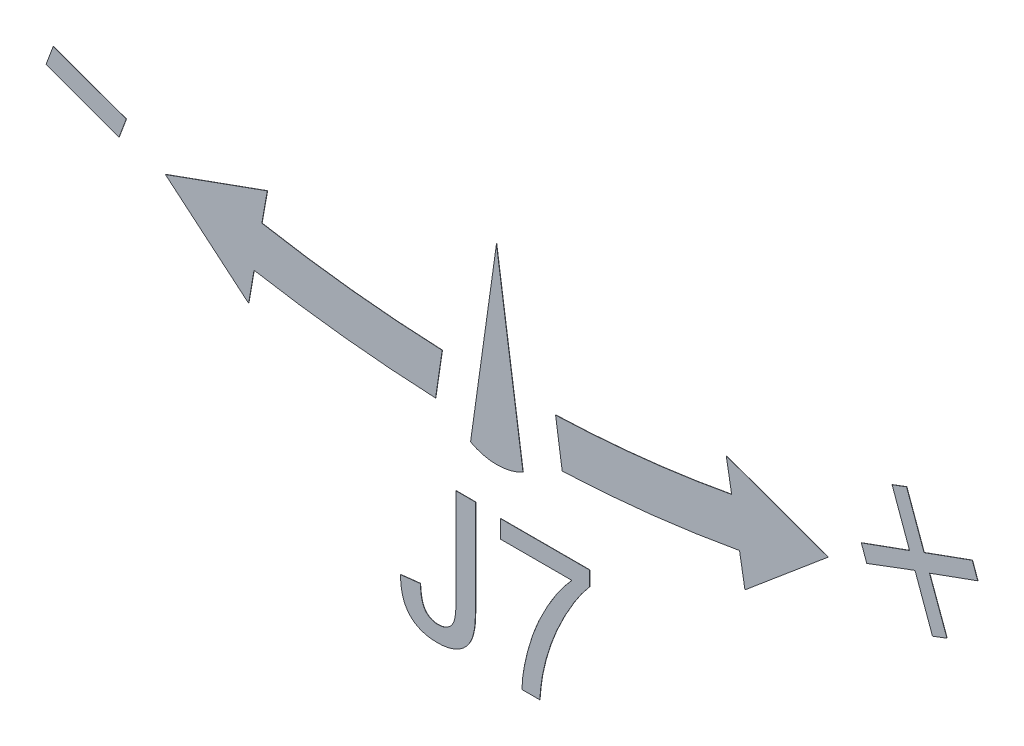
ISO-10303-21;
HEADER;
FILE_DESCRIPTION(('STEP AP214'),'2;1');
FILE_NAME('part.step','',(''),(''),'','','');
FILE_SCHEMA(('AUTOMOTIVE_DESIGN { 1 0 10303 214 1 1 1 1 }'));
ENDSEC;
DATA;
#1=APPLICATION_CONTEXT('core data for automotive mechanical design processes');
#2=APPLICATION_PROTOCOL_DEFINITION('international standard','automotive_design',2000,#1);
#3=PRODUCT_CONTEXT('',#1,'mechanical');
#4=PRODUCT('Part','Part','',(#3));
#5=PRODUCT_RELATED_PRODUCT_CATEGORY('part','',(#4));
#6=PRODUCT_DEFINITION_FORMATION('','',#4);
#7=PRODUCT_DEFINITION_CONTEXT('part definition',#1,'design');
#8=PRODUCT_DEFINITION('design','',#6,#7);
#9=PRODUCT_DEFINITION_SHAPE('','',#8);
#10=(LENGTH_UNIT() NAMED_UNIT(*) SI_UNIT(.MILLI.,.METRE.));
#11=(NAMED_UNIT(*) PLANE_ANGLE_UNIT() SI_UNIT($,.RADIAN.));
#12=(NAMED_UNIT(*) SI_UNIT($,.STERADIAN.) SOLID_ANGLE_UNIT());
#13=UNCERTAINTY_MEASURE_WITH_UNIT(LENGTH_MEASURE(1.E-05),#10,'distance_accuracy_value','');
#14=(GEOMETRIC_REPRESENTATION_CONTEXT(3) GLOBAL_UNCERTAINTY_ASSIGNED_CONTEXT((#13)) GLOBAL_UNIT_ASSIGNED_CONTEXT((#10,
#11,#12)) REPRESENTATION_CONTEXT('',''));
#15=CARTESIAN_POINT('',(0.,0.,0.));
#16=DIRECTION('',(0.,0.,1.));
#17=DIRECTION('',(1.,0.,0.));
#18=AXIS2_PLACEMENT_3D('',#15,#16,#17);
#19=CARTESIAN_POINT('',(178.764725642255,71.5345626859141,0.01004925));
#20=CARTESIAN_POINT('',(178.712748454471,71.5356981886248,0.01004925));
#21=CARTESIAN_POINT('',(178.611502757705,71.5379100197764,0.01004925));
#22=CARTESIAN_POINT('',(178.464308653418,71.5554925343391,0.01004925));
#23=CARTESIAN_POINT('',(178.325992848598,71.5819356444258,0.01004925));
#24=CARTESIAN_POINT('',(178.198275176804,71.6244696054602,0.01004925));
#25=CARTESIAN_POINT('',(178.078564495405,71.6742351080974,0.01004925));
#26=CARTESIAN_POINT('',(177.969177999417,71.7381947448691,0.01004925));
#27=CARTESIAN_POINT('',(177.868243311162,71.8119906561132,0.01004925));
#28=CARTESIAN_POINT('',(177.778315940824,71.8987866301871,0.01004925));
#29=CARTESIAN_POINT('',(177.697226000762,71.9957631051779,0.01004925));
#30=CARTESIAN_POINT('',(177.630173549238,72.1059419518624,0.01004925));
#31=CARTESIAN_POINT('',(177.570916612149,72.2253368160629,0.01004925));
#32=CARTESIAN_POINT('',(177.526180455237,72.3572732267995,0.01004925));
#33=CARTESIAN_POINT('',(177.489484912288,72.4993042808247,0.01004925));
#34=CARTESIAN_POINT('',(177.466787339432,72.6532421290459,0.01004925));
#35=CARTESIAN_POINT('',(177.451878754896,72.8176467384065,0.01004925));
#36=CARTESIAN_POINT('',(177.45243363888,72.9310718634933,0.01004925));
#37=CARTESIAN_POINT('',(177.452718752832,72.9893526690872,0.01004925));
#38=B_SPLINE_CURVE_WITH_KNOTS('',3,(#19,#20,#21,#22,#23,#24,#25,#26,#27,#28,#29,#30,#31,#32,#33,
#34,#35,#36,#37),.UNSPECIFIED.,.F.,.F.,(4,1,1,1,1,1,1,1,1,1,1,1,1,1,1,1,4),(0.,
0.0693843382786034,0.135152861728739,0.197735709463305,0.257048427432,0.314589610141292,
0.370543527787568,0.425833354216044,0.481158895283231,0.537040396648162,0.594138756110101,
0.652974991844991,0.714682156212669,0.779789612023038,0.848620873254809,0.922217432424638,1.),.UNSPECIFIED.);
#39=DIRECTION('',(0.,0.,-1.));
#40=VECTOR('',#39,1.);
#41=SURFACE_OF_LINEAR_EXTRUSION('',#38,#40);
#42=CARTESIAN_POINT('',(178.764725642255,71.5345626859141,0.));
#43=CARTESIAN_POINT('',(178.712748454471,71.5356981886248,0.));
#44=CARTESIAN_POINT('',(178.611502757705,71.5379100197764,0.));
#45=CARTESIAN_POINT('',(178.464308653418,71.5554925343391,0.));
#46=CARTESIAN_POINT('',(178.325992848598,71.5819356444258,0.));
#47=CARTESIAN_POINT('',(178.198275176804,71.6244696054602,0.));
#48=CARTESIAN_POINT('',(178.078564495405,71.6742351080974,0.));
#49=CARTESIAN_POINT('',(177.969177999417,71.7381947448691,0.));
#50=CARTESIAN_POINT('',(177.868243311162,71.8119906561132,0.));
#51=CARTESIAN_POINT('',(177.778315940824,71.8987866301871,0.));
#52=CARTESIAN_POINT('',(177.697226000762,71.9957631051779,0.));
#53=CARTESIAN_POINT('',(177.630173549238,72.1059419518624,0.));
#54=CARTESIAN_POINT('',(177.570916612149,72.2253368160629,0.));
#55=CARTESIAN_POINT('',(177.526180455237,72.3572732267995,0.));
#56=CARTESIAN_POINT('',(177.489484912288,72.4993042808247,0.));
#57=CARTESIAN_POINT('',(177.466787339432,72.6532421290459,0.));
#58=CARTESIAN_POINT('',(177.451878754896,72.8176467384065,0.));
#59=CARTESIAN_POINT('',(177.45243363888,72.9310718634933,0.));
#60=CARTESIAN_POINT('',(177.452718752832,72.9893526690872,0.));
#61=B_SPLINE_CURVE_WITH_KNOTS('',3,(#42,#43,#44,#45,#46,#47,#48,#49,#50,#51,#52,#53,#54,#55,#56,
#57,#58,#59,#60),.UNSPECIFIED.,.F.,.F.,(4,1,1,1,1,1,1,1,1,1,1,1,1,1,1,1,4),(0.,
0.0693843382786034,0.135152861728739,0.197735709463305,0.257048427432,0.314589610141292,
0.370543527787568,0.425833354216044,0.481158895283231,0.537040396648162,0.594138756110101,
0.652974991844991,0.714682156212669,0.779789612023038,0.848620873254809,0.922217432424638,1.),.UNSPECIFIED.);
#62=CARTESIAN_POINT('',(178.764725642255,71.5345626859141,0.));
#63=VERTEX_POINT('',#62);
#64=CARTESIAN_POINT('',(177.452718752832,72.9893526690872,0.));
#65=VERTEX_POINT('',#64);
#66=EDGE_CURVE('E158',#63,#65,#61,.T.);
#67=ORIENTED_EDGE('',*,*,#66,.F.);
#68=DIRECTION('',(0.,0.,-1.));
#69=VECTOR('',#68,1.);
#70=CARTESIAN_POINT('',(178.764725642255,71.5345626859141,0.01004925));
#71=LINE('',#70,#69);
#72=CARTESIAN_POINT('',(178.764725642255,71.5345626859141,0.01004925));
#73=VERTEX_POINT('',#72);
#74=EDGE_CURVE('E12',#73,#63,#71,.T.);
#75=ORIENTED_EDGE('',*,*,#74,.F.);
#76=CARTESIAN_POINT('',(177.452718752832,72.9893526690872,0.01004925));
#77=VERTEX_POINT('',#76);
#78=EDGE_CURVE('E205',#73,#77,#38,.T.);
#79=ORIENTED_EDGE('',*,*,#78,.T.);
#80=DIRECTION('',(0.,0.,-1.));
#81=VECTOR('',#80,1.);
#82=CARTESIAN_POINT('',(177.452718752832,72.9893526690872,0.01004925));
#83=LINE('',#82,#81);
#84=EDGE_CURVE('E53',#77,#65,#83,.T.);
#85=ORIENTED_EDGE('',*,*,#84,.T.);
#86=EDGE_LOOP('',(#67,#75,#79,#85));
#87=FACE_BOUND('',#86,.T.);
#88=ADVANCED_FACE('F49',(#87),#41,.T.);
#89=CARTESIAN_POINT('',(180.136641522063,73.2000326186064,0.01004925));
#90=CARTESIAN_POINT('',(180.136354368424,73.1494351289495,0.01004925));
#91=CARTESIAN_POINT('',(180.13579865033,73.0515156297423,0.01004925));
#92=CARTESIAN_POINT('',(180.128791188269,72.9089415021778,0.01004925));
#93=CARTESIAN_POINT('',(180.116603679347,72.7751046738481,0.01004925));
#94=CARTESIAN_POINT('',(180.101294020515,72.6497115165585,0.01004925));
#95=CARTESIAN_POINT('',(180.080293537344,72.5330270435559,0.01004925));
#96=CARTESIAN_POINT('',(180.054314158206,72.4254405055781,0.01004925));
#97=CARTESIAN_POINT('',(180.024873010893,72.3260783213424,0.01004925));
#98=CARTESIAN_POINT('',(179.978663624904,72.2074882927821,0.01004925));
#99=CARTESIAN_POINT('',(179.908307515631,72.0729458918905,0.01004925));
#100=CARTESIAN_POINT('',(179.800650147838,71.9302534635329,0.01004925));
#101=CARTESIAN_POINT('',(179.670529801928,71.8085264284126,0.01004925));
#102=CARTESIAN_POINT('',(179.519421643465,71.7083405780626,0.01004925));
#103=CARTESIAN_POINT('',(179.350951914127,71.6310228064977,0.01004925));
#104=CARTESIAN_POINT('',(179.168025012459,71.5748864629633,0.01004925));
#105=CARTESIAN_POINT('',(178.971063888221,71.5401472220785,0.01004925));
#106=CARTESIAN_POINT('',(178.834766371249,71.5364583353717,0.01004925));
#107=CARTESIAN_POINT('',(178.764725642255,71.5345626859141,0.01004925));
#108=B_SPLINE_CURVE_WITH_KNOTS('',3,(#89,#90,#91,#92,#93,#94,#95,#96,#97,#98,#99,#100,#101,#102,
#103,#104,#105,#106,#107),.UNSPECIFIED.,.F.,.F.,(4,1,1,1,1,1,1,1,1,1,1,1,1,1,1,1,4),(0.,
0.0612110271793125,0.118459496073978,0.172633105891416,0.223776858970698,0.271245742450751,
0.315976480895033,0.357630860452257,0.396515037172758,0.469825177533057,0.540534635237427,
0.611753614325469,0.684345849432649,0.758929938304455,0.835221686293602,0.915323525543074,1.),.UNSPECIFIED.);
#109=DIRECTION('',(0.,0.,-1.));
#110=VECTOR('',#109,1.);
#111=SURFACE_OF_LINEAR_EXTRUSION('',#108,#110);
#112=CARTESIAN_POINT('',(180.136641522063,73.2000326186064,0.));
#113=CARTESIAN_POINT('',(180.136354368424,73.1494351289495,0.));
#114=CARTESIAN_POINT('',(180.13579865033,73.0515156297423,0.));
#115=CARTESIAN_POINT('',(180.128791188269,72.9089415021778,0.));
#116=CARTESIAN_POINT('',(180.116603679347,72.7751046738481,0.));
#117=CARTESIAN_POINT('',(180.101294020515,72.6497115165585,0.));
#118=CARTESIAN_POINT('',(180.080293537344,72.5330270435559,0.));
#119=CARTESIAN_POINT('',(180.054314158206,72.4254405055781,0.));
#120=CARTESIAN_POINT('',(180.024873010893,72.3260783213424,0.));
#121=CARTESIAN_POINT('',(179.978663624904,72.2074882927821,0.));
#122=CARTESIAN_POINT('',(179.908307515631,72.0729458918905,0.));
#123=CARTESIAN_POINT('',(179.800650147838,71.9302534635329,0.));
#124=CARTESIAN_POINT('',(179.670529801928,71.8085264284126,0.));
#125=CARTESIAN_POINT('',(179.519421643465,71.7083405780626,0.));
#126=CARTESIAN_POINT('',(179.350951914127,71.6310228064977,0.));
#127=CARTESIAN_POINT('',(179.168025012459,71.5748864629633,0.));
#128=CARTESIAN_POINT('',(178.971063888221,71.5401472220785,0.));
#129=CARTESIAN_POINT('',(178.834766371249,71.5364583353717,0.));
#130=CARTESIAN_POINT('',(178.764725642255,71.5345626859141,0.));
#131=B_SPLINE_CURVE_WITH_KNOTS('',3,(#112,#113,#114,#115,#116,#117,#118,#119,#120,#121,#122,
#123,#124,#125,#126,#127,#128,#129,#130),.UNSPECIFIED.,.F.,.F.,(4,1,1,1,1,1,1,1,1,1,1,1,1,1,1,1,
4),(0.,0.0612110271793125,0.118459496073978,0.172633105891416,0.223776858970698,
0.271245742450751,0.315976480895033,0.357630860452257,0.396515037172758,0.469825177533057,
0.540534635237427,0.611753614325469,0.684345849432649,0.758929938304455,0.835221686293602,
0.915323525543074,1.),.UNSPECIFIED.);
#132=CARTESIAN_POINT('',(180.136641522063,73.2000326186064,0.));
#133=VERTEX_POINT('',#132);
#134=EDGE_CURVE('E210',#133,#63,#131,.T.);
#135=ORIENTED_EDGE('',*,*,#134,.F.);
#136=DIRECTION('',(0.,0.,-1.));
#137=VECTOR('',#136,1.);
#138=CARTESIAN_POINT('',(180.136641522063,73.2000326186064,0.01004925));
#139=LINE('',#138,#137);
#140=CARTESIAN_POINT('',(180.136641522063,73.2000326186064,0.01004925));
#141=VERTEX_POINT('',#140);
#142=EDGE_CURVE('E60',#141,#133,#139,.T.);
#143=ORIENTED_EDGE('',*,*,#142,.F.);
#144=EDGE_CURVE('E139',#141,#73,#108,.T.);
#145=ORIENTED_EDGE('',*,*,#144,.T.);
#146=ORIENTED_EDGE('',*,*,#74,.T.);
#147=EDGE_LOOP('',(#135,#143,#145,#146));
#148=FACE_BOUND('',#147,.T.);
#149=ADVANCED_FACE('F166',(#148),#111,.T.);
#150=CARTESIAN_POINT('',(180.136641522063,76.5828936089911,0.01004925));
#151=DIRECTION('',(1.,0.,0.));
#152=DIRECTION('',(0.,0.,-1.));
#153=AXIS2_PLACEMENT_3D('',#150,#151,#152);
#154=PLANE('',#153);
#155=DIRECTION('',(0.,-1.,0.));
#156=VECTOR('',#155,1.);
#157=CARTESIAN_POINT('',(180.136641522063,76.5828936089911,0.));
#158=LINE('',#157,#156);
#159=CARTESIAN_POINT('',(180.136641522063,76.5828936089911,0.));
#160=VERTEX_POINT('',#159);
#161=EDGE_CURVE('E125',#160,#133,#158,.T.);
#162=ORIENTED_EDGE('',*,*,#161,.F.);
#163=DIRECTION('',(0.,0.,-1.));
#164=VECTOR('',#163,1.);
#165=CARTESIAN_POINT('',(180.136641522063,76.5828936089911,0.01004925));
#166=LINE('',#165,#164);
#167=CARTESIAN_POINT('',(180.136641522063,76.5828936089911,0.01004925));
#168=VERTEX_POINT('',#167);
#169=EDGE_CURVE('E120',#168,#160,#166,.T.);
#170=ORIENTED_EDGE('',*,*,#169,.F.);
#171=DIRECTION('',(0.,-1.,0.));
#172=VECTOR('',#171,1.);
#173=CARTESIAN_POINT('',(180.136641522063,76.5828936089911,0.01004925));
#174=LINE('',#173,#172);
#175=EDGE_CURVE('E123',#168,#141,#174,.T.);
#176=ORIENTED_EDGE('',*,*,#175,.T.);
#177=ORIENTED_EDGE('',*,*,#142,.T.);
#178=EDGE_LOOP('',(#162,#170,#176,#177));
#179=FACE_BOUND('',#178,.T.);
#180=ADVANCED_FACE('F122',(#179),#154,.T.);
#181=CARTESIAN_POINT('',(179.433709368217,76.5828936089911,0.01004925));
#182=DIRECTION('',(0.,1.,0.));
#183=DIRECTION('',(0.,0.,1.));
#184=AXIS2_PLACEMENT_3D('',#181,#182,#183);
#185=PLANE('',#184);
#186=DIRECTION('',(1.,0.,0.));
#187=VECTOR('',#186,1.);
#188=CARTESIAN_POINT('',(179.433709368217,76.5828936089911,0.));
#189=LINE('',#188,#187);
#190=CARTESIAN_POINT('',(179.433709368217,76.5828936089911,0.));
#191=VERTEX_POINT('',#190);
#192=EDGE_CURVE('E222',#191,#160,#189,.T.);
#193=ORIENTED_EDGE('',*,*,#192,.F.);
#194=DIRECTION('',(0.,0.,-1.));
#195=VECTOR('',#194,1.);
#196=CARTESIAN_POINT('',(179.433709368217,76.5828936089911,0.01004925));
#197=LINE('',#196,#195);
#198=CARTESIAN_POINT('',(179.433709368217,76.5828936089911,0.01004925));
#199=VERTEX_POINT('',#198);
#200=EDGE_CURVE('E131',#199,#191,#197,.T.);
#201=ORIENTED_EDGE('',*,*,#200,.F.);
#202=DIRECTION('',(1.,0.,0.));
#203=VECTOR('',#202,1.);
#204=CARTESIAN_POINT('',(179.433709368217,76.5828936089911,0.01004925));
#205=LINE('',#204,#203);
#206=EDGE_CURVE('E137',#199,#168,#205,.T.);
#207=ORIENTED_EDGE('',*,*,#206,.T.);
#208=ORIENTED_EDGE('',*,*,#169,.T.);
#209=EDGE_LOOP('',(#193,#201,#207,#208));
#210=FACE_BOUND('',#209,.T.);
#211=ADVANCED_FACE('F142',(#210),#185,.T.);
#212=CARTESIAN_POINT('',(179.433709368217,73.155100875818,0.01004925));
#213=DIRECTION('',(-1.,0.,0.));
#214=DIRECTION('',(0.,0.,1.));
#215=AXIS2_PLACEMENT_3D('',#212,#213,#214);
#216=PLANE('',#215);
#217=DIRECTION('',(0.,1.,0.));
#218=VECTOR('',#217,1.);
#219=CARTESIAN_POINT('',(179.433709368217,73.155100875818,0.));
#220=LINE('',#219,#218);
#221=CARTESIAN_POINT('',(179.433709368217,73.155100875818,0.));
#222=VERTEX_POINT('',#221);
#223=EDGE_CURVE('E332',#222,#191,#220,.T.);
#224=ORIENTED_EDGE('',*,*,#223,.F.);
#225=DIRECTION('',(0.,0.,-1.));
#226=VECTOR('',#225,1.);
#227=CARTESIAN_POINT('',(179.433709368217,73.155100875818,0.01004925));
#228=LINE('',#227,#226);
#229=CARTESIAN_POINT('',(179.433709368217,73.155100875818,0.01004925));
#230=VERTEX_POINT('',#229);
#231=EDGE_CURVE('E235',#230,#222,#228,.T.);
#232=ORIENTED_EDGE('',*,*,#231,.F.);
#233=DIRECTION('',(0.,1.,0.));
#234=VECTOR('',#233,1.);
#235=CARTESIAN_POINT('',(179.433709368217,73.155100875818,0.01004925));
#236=LINE('',#235,#234);
#237=EDGE_CURVE('E144',#230,#199,#236,.T.);
#238=ORIENTED_EDGE('',*,*,#237,.T.);
#239=ORIENTED_EDGE('',*,*,#200,.T.);
#240=EDGE_LOOP('',(#224,#232,#238,#239));
#241=FACE_BOUND('',#240,.T.);
#242=ADVANCED_FACE('F176',(#241),#216,.T.);
#243=CARTESIAN_POINT('',(178.793681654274,72.1096889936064,0.01004925));
#244=CARTESIAN_POINT('',(178.828103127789,72.1108409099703,0.01004925));
#245=CARTESIAN_POINT('',(178.895362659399,72.1130917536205,0.01004925));
#246=CARTESIAN_POINT('',(178.991838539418,72.1362251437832,0.01004925));
#247=CARTESIAN_POINT('',(179.081730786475,72.1709333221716,0.01004925));
#248=CARTESIAN_POINT('',(179.162496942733,72.2216124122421,0.01004925));
#249=CARTESIAN_POINT('',(179.234505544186,72.2832789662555,0.01004925));
#250=CARTESIAN_POINT('',(179.295757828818,72.3560493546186,0.01004925));
#251=CARTESIAN_POINT('',(179.342415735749,72.4401487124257,0.01004925));
#252=CARTESIAN_POINT('',(179.371801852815,72.5177953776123,0.01004925));
#253=CARTESIAN_POINT('',(179.389827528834,72.5869046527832,0.01004925));
#254=CARTESIAN_POINT('',(179.401624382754,72.6469413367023,0.01004925));
#255=CARTESIAN_POINT('',(179.411569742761,72.7139187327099,0.01004925));
#256=CARTESIAN_POINT('',(179.419081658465,72.7882566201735,0.01004925));
#257=CARTESIAN_POINT('',(179.426708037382,72.8697393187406,0.01004925));
#258=CARTESIAN_POINT('',(179.42975472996,72.9587230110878,0.01004925));
#259=CARTESIAN_POINT('',(179.433305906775,73.0545596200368,0.01004925));
#260=CARTESIAN_POINT('',(179.433571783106,73.1208151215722,0.01004925));
#261=CARTESIAN_POINT('',(179.433709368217,73.155100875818,0.01004925));
#262=B_SPLINE_CURVE_WITH_KNOTS('',3,(#243,#244,#245,#246,#247,#248,#249,#250,#251,#252,#253,
#254,#255,#256,#257,#258,#259,#260,#261),.UNSPECIFIED.,.F.,.F.,(4,1,1,1,1,1,1,1,1,1,1,1,1,1,1,1,
4),(0.,0.0735942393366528,0.143803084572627,0.211314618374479,0.279171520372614,
0.346904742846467,0.413716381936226,0.481711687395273,0.551880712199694,0.590958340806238,
0.63457715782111,0.682868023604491,0.735927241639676,0.794594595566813,0.858103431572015,
0.92657166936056,1.),.UNSPECIFIED.);
#263=DIRECTION('',(0.,0.,-1.));
#264=VECTOR('',#263,1.);
#265=SURFACE_OF_LINEAR_EXTRUSION('',#262,#264);
#266=CARTESIAN_POINT('',(178.793681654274,72.1096889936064,0.));
#267=CARTESIAN_POINT('',(178.828103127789,72.1108409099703,0.));
#268=CARTESIAN_POINT('',(178.895362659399,72.1130917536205,0.));
#269=CARTESIAN_POINT('',(178.991838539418,72.1362251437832,0.));
#270=CARTESIAN_POINT('',(179.081730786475,72.1709333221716,0.));
#271=CARTESIAN_POINT('',(179.162496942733,72.2216124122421,0.));
#272=CARTESIAN_POINT('',(179.234505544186,72.2832789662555,0.));
#273=CARTESIAN_POINT('',(179.295757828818,72.3560493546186,0.));
#274=CARTESIAN_POINT('',(179.342415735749,72.4401487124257,0.));
#275=CARTESIAN_POINT('',(179.371801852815,72.5177953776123,0.));
#276=CARTESIAN_POINT('',(179.389827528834,72.5869046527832,0.));
#277=CARTESIAN_POINT('',(179.401624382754,72.6469413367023,0.));
#278=CARTESIAN_POINT('',(179.411569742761,72.7139187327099,0.));
#279=CARTESIAN_POINT('',(179.419081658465,72.7882566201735,0.));
#280=CARTESIAN_POINT('',(179.426708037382,72.8697393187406,0.));
#281=CARTESIAN_POINT('',(179.42975472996,72.9587230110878,0.));
#282=CARTESIAN_POINT('',(179.433305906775,73.0545596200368,0.));
#283=CARTESIAN_POINT('',(179.433571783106,73.1208151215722,0.));
#284=CARTESIAN_POINT('',(179.433709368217,73.155100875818,0.));
#285=B_SPLINE_CURVE_WITH_KNOTS('',3,(#266,#267,#268,#269,#270,#271,#272,#273,#274,#275,#276,
#277,#278,#279,#280,#281,#282,#283,#284),.UNSPECIFIED.,.F.,.F.,(4,1,1,1,1,1,1,1,1,1,1,1,1,1,1,1,
4),(0.,0.0735942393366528,0.143803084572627,0.211314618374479,0.279171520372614,
0.346904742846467,0.413716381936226,0.481711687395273,0.551880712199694,0.590958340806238,
0.63457715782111,0.682868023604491,0.735927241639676,0.794594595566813,0.858103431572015,
0.92657166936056,1.),.UNSPECIFIED.);
#286=CARTESIAN_POINT('',(178.793681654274,72.1096889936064,0.));
#287=VERTEX_POINT('',#286);
#288=EDGE_CURVE('E329',#287,#222,#285,.T.);
#289=ORIENTED_EDGE('',*,*,#288,.F.);
#290=DIRECTION('',(0.,0.,-1.));
#291=VECTOR('',#290,1.);
#292=CARTESIAN_POINT('',(178.793681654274,72.1096889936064,0.01004925));
#293=LINE('',#292,#291);
#294=CARTESIAN_POINT('',(178.793681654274,72.1096889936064,0.01004925));
#295=VERTEX_POINT('',#294);
#296=EDGE_CURVE('E238',#295,#287,#293,.T.);
#297=ORIENTED_EDGE('',*,*,#296,.F.);
#298=EDGE_CURVE('E149',#295,#230,#262,.T.);
#299=ORIENTED_EDGE('',*,*,#298,.T.);
#300=ORIENTED_EDGE('',*,*,#231,.T.);
#301=EDGE_LOOP('',(#289,#297,#299,#300));
#302=FACE_BOUND('',#301,.T.);
#303=ADVANCED_FACE('F179',(#302),#265,.T.);
#304=CARTESIAN_POINT('',(178.155650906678,73.0682328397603,0.01004925));
#305=CARTESIAN_POINT('',(178.157550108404,73.023939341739,0.01004925));
#306=CARTESIAN_POINT('',(178.161183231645,72.9392070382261,0.01004925));
#307=CARTESIAN_POINT('',(178.173228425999,72.8175621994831,0.01004925));
#308=CARTESIAN_POINT('',(178.190043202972,72.7069232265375,0.01004925));
#309=CARTESIAN_POINT('',(178.210865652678,72.6068860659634,0.01004925));
#310=CARTESIAN_POINT('',(178.235123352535,72.5173812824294,0.01004925));
#311=CARTESIAN_POINT('',(178.265558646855,72.4391309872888,0.01004925));
#312=CARTESIAN_POINT('',(178.298337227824,72.3704911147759,0.01004925));
#313=CARTESIAN_POINT('',(178.338638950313,72.313596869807,0.01004925));
#314=CARTESIAN_POINT('',(178.381849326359,72.2649720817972,0.01004925));
#315=CARTESIAN_POINT('',(178.429384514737,72.2236850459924,0.01004925));
#316=CARTESIAN_POINT('',(178.48063129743,72.1885028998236,0.01004925));
#317=CARTESIAN_POINT('',(178.535487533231,72.159439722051,0.01004925));
#318=CARTESIAN_POINT('',(178.594570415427,72.1371469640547,0.01004925));
#319=CARTESIAN_POINT('',(178.657265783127,72.1216616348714,0.01004925));
#320=CARTESIAN_POINT('',(178.724090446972,72.1109415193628,0.01004925));
#321=CARTESIAN_POINT('',(178.770005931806,72.1101151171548,0.01004925));
#322=CARTESIAN_POINT('',(178.793681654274,72.1096889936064,0.01004925));
#323=B_SPLINE_CURVE_WITH_KNOTS('',3,(#304,#305,#306,#307,#308,#309,#310,#311,#312,#313,#314,
#315,#316,#317,#318,#319,#320,#321,#322),.UNSPECIFIED.,.F.,.F.,(4,1,1,1,1,1,1,1,1,1,1,1,1,1,1,1,
4),(0.,0.102038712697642,0.195197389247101,0.281231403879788,0.359517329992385,
0.430343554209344,0.494370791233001,0.552618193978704,0.604901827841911,0.654275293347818,
0.702059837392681,0.749449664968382,0.797086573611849,0.844612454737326,0.894412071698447,
0.945554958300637,1.),.UNSPECIFIED.);
#324=DIRECTION('',(0.,0.,-1.));
#325=VECTOR('',#324,1.);
#326=SURFACE_OF_LINEAR_EXTRUSION('',#323,#325);
#327=CARTESIAN_POINT('',(178.155650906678,73.0682328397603,0.));
#328=CARTESIAN_POINT('',(178.157550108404,73.023939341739,0.));
#329=CARTESIAN_POINT('',(178.161183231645,72.9392070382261,0.));
#330=CARTESIAN_POINT('',(178.173228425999,72.8175621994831,0.));
#331=CARTESIAN_POINT('',(178.190043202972,72.7069232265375,0.));
#332=CARTESIAN_POINT('',(178.210865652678,72.6068860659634,0.));
#333=CARTESIAN_POINT('',(178.235123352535,72.5173812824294,0.));
#334=CARTESIAN_POINT('',(178.265558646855,72.4391309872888,0.));
#335=CARTESIAN_POINT('',(178.298337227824,72.3704911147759,0.));
#336=CARTESIAN_POINT('',(178.338638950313,72.313596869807,0.));
#337=CARTESIAN_POINT('',(178.381849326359,72.2649720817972,0.));
#338=CARTESIAN_POINT('',(178.429384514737,72.2236850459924,0.));
#339=CARTESIAN_POINT('',(178.48063129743,72.1885028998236,0.));
#340=CARTESIAN_POINT('',(178.535487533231,72.159439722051,0.));
#341=CARTESIAN_POINT('',(178.594570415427,72.1371469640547,0.));
#342=CARTESIAN_POINT('',(178.657265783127,72.1216616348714,0.));
#343=CARTESIAN_POINT('',(178.724090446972,72.1109415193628,0.));
#344=CARTESIAN_POINT('',(178.770005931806,72.1101151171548,0.));
#345=CARTESIAN_POINT('',(178.793681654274,72.1096889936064,0.));
#346=B_SPLINE_CURVE_WITH_KNOTS('',3,(#327,#328,#329,#330,#331,#332,#333,#334,#335,#336,#337,
#338,#339,#340,#341,#342,#343,#344,#345),.UNSPECIFIED.,.F.,.F.,(4,1,1,1,1,1,1,1,1,1,1,1,1,1,1,1,
4),(0.,0.102038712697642,0.195197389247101,0.281231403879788,0.359517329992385,
0.430343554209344,0.494370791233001,0.552618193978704,0.604901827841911,0.654275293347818,
0.702059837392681,0.749449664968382,0.797086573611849,0.844612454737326,0.894412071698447,
0.945554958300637,1.),.UNSPECIFIED.);
#347=CARTESIAN_POINT('',(178.155650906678,73.0682328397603,0.));
#348=VERTEX_POINT('',#347);
#349=EDGE_CURVE('E247',#348,#287,#346,.T.);
#350=ORIENTED_EDGE('',*,*,#349,.F.);
#351=DIRECTION('',(0.,0.,-1.));
#352=VECTOR('',#351,1.);
#353=CARTESIAN_POINT('',(178.155650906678,73.0682328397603,0.01004925));
#354=LINE('',#353,#352);
#355=CARTESIAN_POINT('',(178.155650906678,73.0682328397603,0.01004925));
#356=VERTEX_POINT('',#355);
#357=EDGE_CURVE('E240',#356,#348,#354,.T.);
#358=ORIENTED_EDGE('',*,*,#357,.F.);
#359=EDGE_CURVE('E191',#356,#295,#323,.T.);
#360=ORIENTED_EDGE('',*,*,#359,.T.);
#361=ORIENTED_EDGE('',*,*,#296,.T.);
#362=EDGE_LOOP('',(#350,#358,#360,#361));
#363=FACE_BOUND('',#362,.T.);
#364=ADVANCED_FACE('F183',(#363),#326,.T.);
#365=CARTESIAN_POINT('',(177.452718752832,72.9893526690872,0.01004925));
#366=DIRECTION('',(-0.111515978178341,0.993762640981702,0.));
#367=DIRECTION('',(-0.993762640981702,-0.111515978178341,0.));
#368=AXIS2_PLACEMENT_3D('',#365,#366,#367);
#369=PLANE('',#368);
#370=DIRECTION('',(0.993762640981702,0.111515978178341,0.));
#371=VECTOR('',#370,1.);
#372=CARTESIAN_POINT('',(177.452718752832,72.9893526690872,0.));
#373=LINE('',#372,#371);
#374=EDGE_CURVE('E243',#65,#348,#373,.T.);
#375=ORIENTED_EDGE('',*,*,#374,.F.);
#376=ORIENTED_EDGE('',*,*,#84,.F.);
#377=DIRECTION('',(0.993762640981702,0.111515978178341,0.));
#378=VECTOR('',#377,1.);
#379=CARTESIAN_POINT('',(177.452718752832,72.9893526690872,0.01004925));
#380=LINE('',#379,#378);
#381=EDGE_CURVE('E201',#77,#356,#380,.T.);
#382=ORIENTED_EDGE('',*,*,#381,.T.);
#383=ORIENTED_EDGE('',*,*,#357,.T.);
#384=EDGE_LOOP('',(#375,#376,#382,#383));
#385=FACE_BOUND('',#384,.T.);
#386=ADVANCED_FACE('F244',(#385),#369,.T.);
#387=CARTESIAN_POINT('',(177.751924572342,71.9315524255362,0.01004925));
#388=DIRECTION('',(0.,0.,1.));
#389=DIRECTION('',(1.,0.,0.));
#390=AXIS2_PLACEMENT_3D('',#387,#388,#389);
#391=PLANE('',#390);
#392=ORIENTED_EDGE('',*,*,#78,.F.);
#393=ORIENTED_EDGE('',*,*,#144,.F.);
#394=ORIENTED_EDGE('',*,*,#175,.F.);
#395=ORIENTED_EDGE('',*,*,#206,.F.);
#396=ORIENTED_EDGE('',*,*,#237,.F.);
#397=ORIENTED_EDGE('',*,*,#298,.F.);
#398=ORIENTED_EDGE('',*,*,#359,.F.);
#399=ORIENTED_EDGE('',*,*,#381,.F.);
#400=EDGE_LOOP('',(#392,#393,#394,#395,#396,#397,#398,#399));
#401=FACE_BOUND('',#400,.T.);
#402=ADVANCED_FACE('F135',(#401),#391,.T.);
#403=CARTESIAN_POINT('',(177.751924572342,71.9315524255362,0.));
#404=DIRECTION('',(0.,0.,1.));
#405=DIRECTION('',(1.,0.,0.));
#406=AXIS2_PLACEMENT_3D('',#403,#404,#405);
#407=PLANE('',#406);
#408=ORIENTED_EDGE('',*,*,#66,.T.);
#409=ORIENTED_EDGE('',*,*,#374,.T.);
#410=ORIENTED_EDGE('',*,*,#349,.T.);
#411=ORIENTED_EDGE('',*,*,#288,.T.);
#412=ORIENTED_EDGE('',*,*,#223,.T.);
#413=ORIENTED_EDGE('',*,*,#192,.T.);
#414=ORIENTED_EDGE('',*,*,#161,.T.);
#415=ORIENTED_EDGE('',*,*,#134,.T.);
#416=EDGE_LOOP('',(#408,#409,#410,#411,#412,#413,#414,#415));
#417=FACE_BOUND('',#416,.T.);
#418=ADVANCED_FACE('F170',(#417),#407,.F.);
#419=CLOSED_SHELL('',(#88,#149,#180,#211,#242,#303,#364,#386,#402,#418));
#420=MANIFOLD_SOLID_BREP('B2',#419);
#421=CARTESIAN_POINT('',(183.587399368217,75.8799614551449,0.01004925));
#422=DIRECTION('',(0.,-1.,0.));
#423=DIRECTION('',(0.,0.,-1.));
#424=AXIS2_PLACEMENT_3D('',#421,#422,#423);
#425=PLANE('',#424);
#426=DIRECTION('',(-1.,0.,0.));
#427=VECTOR('',#426,1.);
#428=CARTESIAN_POINT('',(183.587399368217,75.8799614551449,0.));
#429=LINE('',#428,#427);
#430=CARTESIAN_POINT('',(183.587399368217,75.8799614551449,0.));
#431=VERTEX_POINT('',#430);
#432=CARTESIAN_POINT('',(181.03128244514,75.8799614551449,0.));
#433=VERTEX_POINT('',#432);
#434=EDGE_CURVE('E505',#431,#433,#429,.T.);
#435=ORIENTED_EDGE('',*,*,#434,.F.);
#436=DIRECTION('',(0.,0.,-1.));
#437=VECTOR('',#436,1.);
#438=CARTESIAN_POINT('',(183.587399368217,75.8799614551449,0.01004925));
#439=LINE('',#438,#437);
#440=CARTESIAN_POINT('',(183.587399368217,75.8799614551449,0.01004925));
#441=VERTEX_POINT('',#440);
#442=EDGE_CURVE('E47',#441,#431,#439,.T.);
#443=ORIENTED_EDGE('',*,*,#442,.F.);
#444=DIRECTION('',(-1.,0.,0.));
#445=VECTOR('',#444,1.);
#446=CARTESIAN_POINT('',(183.587399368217,75.8799614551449,0.01004925));
#447=LINE('',#446,#445);
#448=CARTESIAN_POINT('',(181.03128244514,75.8799614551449,0.01004925));
#449=VERTEX_POINT('',#448);
#450=EDGE_CURVE('E514',#441,#449,#447,.T.);
#451=ORIENTED_EDGE('',*,*,#450,.T.);
#452=DIRECTION('',(0.,0.,-1.));
#453=VECTOR('',#452,1.);
#454=CARTESIAN_POINT('',(181.03128244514,75.8799614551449,0.01004925));
#455=LINE('',#454,#453);
#456=EDGE_CURVE('E367',#449,#433,#455,.T.);
#457=ORIENTED_EDGE('',*,*,#456,.T.);
#458=EDGE_LOOP('',(#435,#443,#451,#457));
#459=FACE_BOUND('',#458,.T.);
#460=ADVANCED_FACE('F364',(#459),#425,.T.);
#461=CARTESIAN_POINT('',(181.798117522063,71.598465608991,0.01004925));
#462=CARTESIAN_POINT('',(181.799650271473,71.6480830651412,0.01004925));
#463=CARTESIAN_POINT('',(181.802802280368,71.7501184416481,0.01004925));
#464=CARTESIAN_POINT('',(181.81674072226,71.9069066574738,0.01004925));
#465=CARTESIAN_POINT('',(181.835305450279,72.0714860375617,0.01004925));
#466=CARTESIAN_POINT('',(181.861526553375,72.2433005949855,0.01004925));
#467=CARTESIAN_POINT('',(181.894855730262,72.4226990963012,0.01004925));
#468=CARTESIAN_POINT('',(181.934571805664,72.6098715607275,0.01004925));
#469=CARTESIAN_POINT('',(181.982004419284,72.8044308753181,0.01004925));
#470=CARTESIAN_POINT('',(182.052154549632,73.0741746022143,0.01004925));
#471=CARTESIAN_POINT('',(182.156338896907,73.4133550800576,0.01004925));
#472=CARTESIAN_POINT('',(182.308023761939,73.8144048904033,0.01004925));
#473=CARTESIAN_POINT('',(182.482465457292,74.2085726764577,0.01004925));
#474=CARTESIAN_POINT('',(182.648956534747,74.5282218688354,0.01004925));
#475=CARTESIAN_POINT('',(182.790932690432,74.7771391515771,0.01004925));
#476=CARTESIAN_POINT('',(182.898672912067,74.9577478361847,0.01004925));
#477=CARTESIAN_POINT('',(183.009476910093,75.1298479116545,0.01004925));
#478=CARTESIAN_POINT('',(183.121290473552,75.2946774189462,0.01004925));
#479=CARTESIAN_POINT('',(183.234132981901,75.4523751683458,0.01004925));
#480=CARTESIAN_POINT('',(183.35030309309,75.6014671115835,0.01004925));
#481=CARTESIAN_POINT('',(183.466375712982,75.7449484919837,0.01004925));
#482=CARTESIAN_POINT('',(183.54741392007,75.8353540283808,0.01004925));
#483=CARTESIAN_POINT('',(183.587399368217,75.8799614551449,0.01004925));
#484=B_SPLINE_CURVE_WITH_KNOTS('',3,(#461,#462,#463,#464,#465,#466,#467,#468,#469,#470,#471,
#472,#473,#474,#475,#476,#477,#478,#479,#480,#481,#482,#483),.UNSPECIFIED.,.F.,.F.,(4,1,1,1,1,1,
1,1,1,1,1,1,1,1,1,1,1,1,1,1,4),(0.,0.0315156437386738,0.0648100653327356,0.0999121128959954,
0.136676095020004,0.175144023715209,0.215765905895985,0.258157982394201,0.30229429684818,
0.392742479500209,0.483300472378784,0.574413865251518,0.666292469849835,0.712009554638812,
0.756373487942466,0.799814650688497,0.841961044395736,0.882842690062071,0.922917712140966,
0.961966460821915,1.),.UNSPECIFIED.);
#485=DIRECTION('',(0.,0.,-1.));
#486=VECTOR('',#485,1.);
#487=SURFACE_OF_LINEAR_EXTRUSION('',#484,#486);
#488=CARTESIAN_POINT('',(181.798117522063,71.598465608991,0.));
#489=CARTESIAN_POINT('',(181.799650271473,71.6480830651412,0.));
#490=CARTESIAN_POINT('',(181.802802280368,71.7501184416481,0.));
#491=CARTESIAN_POINT('',(181.81674072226,71.9069066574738,0.));
#492=CARTESIAN_POINT('',(181.835305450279,72.0714860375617,0.));
#493=CARTESIAN_POINT('',(181.861526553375,72.2433005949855,0.));
#494=CARTESIAN_POINT('',(181.894855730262,72.4226990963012,0.));
#495=CARTESIAN_POINT('',(181.934571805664,72.6098715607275,0.));
#496=CARTESIAN_POINT('',(181.982004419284,72.8044308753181,0.));
#497=CARTESIAN_POINT('',(182.052154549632,73.0741746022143,0.));
#498=CARTESIAN_POINT('',(182.156338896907,73.4133550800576,0.));
#499=CARTESIAN_POINT('',(182.308023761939,73.8144048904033,0.));
#500=CARTESIAN_POINT('',(182.482465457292,74.2085726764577,0.));
#501=CARTESIAN_POINT('',(182.648956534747,74.5282218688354,0.));
#502=CARTESIAN_POINT('',(182.790932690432,74.7771391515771,0.));
#503=CARTESIAN_POINT('',(182.898672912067,74.9577478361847,0.));
#504=CARTESIAN_POINT('',(183.009476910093,75.1298479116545,0.));
#505=CARTESIAN_POINT('',(183.121290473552,75.2946774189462,0.));
#506=CARTESIAN_POINT('',(183.234132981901,75.4523751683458,0.));
#507=CARTESIAN_POINT('',(183.35030309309,75.6014671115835,0.));
#508=CARTESIAN_POINT('',(183.466375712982,75.7449484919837,0.));
#509=CARTESIAN_POINT('',(183.54741392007,75.8353540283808,0.));
#510=CARTESIAN_POINT('',(183.587399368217,75.8799614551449,0.));
#511=B_SPLINE_CURVE_WITH_KNOTS('',3,(#488,#489,#490,#491,#492,#493,#494,#495,#496,#497,#498,
#499,#500,#501,#502,#503,#504,#505,#506,#507,#508,#509,#510),.UNSPECIFIED.,.F.,.F.,(4,1,1,1,1,1,
1,1,1,1,1,1,1,1,1,1,1,1,1,1,4),(0.,0.0315156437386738,0.0648100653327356,0.0999121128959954,
0.136676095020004,0.175144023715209,0.215765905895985,0.258157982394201,0.30229429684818,
0.392742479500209,0.483300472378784,0.574413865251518,0.666292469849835,0.712009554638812,
0.756373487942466,0.799814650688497,0.841961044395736,0.882842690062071,0.922917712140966,
0.961966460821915,1.),.UNSPECIFIED.);
#512=CARTESIAN_POINT('',(181.798117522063,71.598465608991,0.));
#513=VERTEX_POINT('',#512);
#514=EDGE_CURVE('E512',#513,#431,#511,.T.);
#515=ORIENTED_EDGE('',*,*,#514,.F.);
#516=DIRECTION('',(0.,0.,-1.));
#517=VECTOR('',#516,1.);
#518=CARTESIAN_POINT('',(181.798117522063,71.598465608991,0.01004925));
#519=LINE('',#518,#517);
#520=CARTESIAN_POINT('',(181.798117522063,71.598465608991,0.01004925));
#521=VERTEX_POINT('',#520);
#522=EDGE_CURVE('E374',#521,#513,#519,.T.);
#523=ORIENTED_EDGE('',*,*,#522,.F.);
#524=EDGE_CURVE('E453',#521,#441,#484,.T.);
#525=ORIENTED_EDGE('',*,*,#524,.T.);
#526=ORIENTED_EDGE('',*,*,#442,.T.);
#527=EDGE_LOOP('',(#515,#523,#525,#526));
#528=FACE_BOUND('',#527,.T.);
#529=ADVANCED_FACE('F500',(#528),#487,.T.);
#530=CARTESIAN_POINT('',(182.437146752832,71.598465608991,0.01004925));
#531=DIRECTION('',(0.,-1.,0.));
#532=DIRECTION('',(0.,0.,-1.));
#533=AXIS2_PLACEMENT_3D('',#530,#531,#532);
#534=PLANE('',#533);
#535=DIRECTION('',(-1.,0.,0.));
#536=VECTOR('',#535,1.);
#537=CARTESIAN_POINT('',(182.437146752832,71.598465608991,0.));
#538=LINE('',#537,#536);
#539=CARTESIAN_POINT('',(182.437146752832,71.598465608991,0.));
#540=VERTEX_POINT('',#539);
#541=EDGE_CURVE('E439',#540,#513,#538,.T.);
#542=ORIENTED_EDGE('',*,*,#541,.F.);
#543=DIRECTION('',(0.,0.,-1.));
#544=VECTOR('',#543,1.);
#545=CARTESIAN_POINT('',(182.437146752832,71.598465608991,0.01004925));
#546=LINE('',#545,#544);
#547=CARTESIAN_POINT('',(182.437146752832,71.598465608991,0.01004925));
#548=VERTEX_POINT('',#547);
#549=EDGE_CURVE('E434',#548,#540,#546,.T.);
#550=ORIENTED_EDGE('',*,*,#549,.F.);
#551=DIRECTION('',(-1.,0.,0.));
#552=VECTOR('',#551,1.);
#553=CARTESIAN_POINT('',(182.437146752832,71.598465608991,0.01004925));
#554=LINE('',#553,#552);
#555=EDGE_CURVE('E437',#548,#521,#554,.T.);
#556=ORIENTED_EDGE('',*,*,#555,.T.);
#557=ORIENTED_EDGE('',*,*,#522,.T.);
#558=EDGE_LOOP('',(#542,#550,#556,#557));
#559=FACE_BOUND('',#558,.T.);
#560=ADVANCED_FACE('F436',(#559),#534,.T.);
#561=CARTESIAN_POINT('',(182.657811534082,72.9534072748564,0.01004925));
#562=CARTESIAN_POINT('',(182.630239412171,72.8481944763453,0.01004925));
#563=CARTESIAN_POINT('',(182.574147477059,72.6341525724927,0.01004925));
#564=CARTESIAN_POINT('',(182.512744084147,72.3017726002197,0.01004925));
#565=CARTESIAN_POINT('',(182.465270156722,71.9552164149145,0.01004925));
#566=CARTESIAN_POINT('',(182.446628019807,71.7187373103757,0.01004925));
#567=CARTESIAN_POINT('',(182.437146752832,71.598465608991,0.01004925));
#568=B_SPLINE_CURVE_WITH_KNOTS('',3,(#561,#562,#563,#564,#565,#566,#567),.UNSPECIFIED.,.F.,.F.,
(4,1,1,1,4),(0.,0.237216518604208,0.482586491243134,0.736846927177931,1.),.UNSPECIFIED.);
#569=DIRECTION('',(0.,0.,-1.));
#570=VECTOR('',#569,1.);
#571=SURFACE_OF_LINEAR_EXTRUSION('',#568,#570);
#572=CARTESIAN_POINT('',(182.657811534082,72.9534072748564,0.));
#573=CARTESIAN_POINT('',(182.630239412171,72.8481944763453,0.));
#574=CARTESIAN_POINT('',(182.574147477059,72.6341525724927,0.));
#575=CARTESIAN_POINT('',(182.512744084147,72.3017726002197,0.));
#576=CARTESIAN_POINT('',(182.465270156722,71.9552164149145,0.));
#577=CARTESIAN_POINT('',(182.446628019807,71.7187373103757,0.));
#578=CARTESIAN_POINT('',(182.437146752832,71.598465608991,0.));
#579=B_SPLINE_CURVE_WITH_KNOTS('',3,(#572,#573,#574,#575,#576,#577,#578),.UNSPECIFIED.,.F.,.F.,
(4,1,1,1,4),(0.,0.237216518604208,0.482586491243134,0.736846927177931,1.),.UNSPECIFIED.);
#580=CARTESIAN_POINT('',(182.657811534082,72.9534072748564,0.));
#581=VERTEX_POINT('',#580);
#582=EDGE_CURVE('E522',#581,#540,#579,.T.);
#583=ORIENTED_EDGE('',*,*,#582,.F.);
#584=DIRECTION('',(0.,0.,-1.));
#585=VECTOR('',#584,1.);
#586=CARTESIAN_POINT('',(182.657811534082,72.9534072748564,0.01004925));
#587=LINE('',#586,#585);
#588=CARTESIAN_POINT('',(182.657811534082,72.9534072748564,0.01004925));
#589=VERTEX_POINT('',#588);
#590=EDGE_CURVE('E445',#589,#581,#587,.T.);
#591=ORIENTED_EDGE('',*,*,#590,.F.);
#592=EDGE_CURVE('E451',#589,#548,#568,.T.);
#593=ORIENTED_EDGE('',*,*,#592,.T.);
#594=ORIENTED_EDGE('',*,*,#549,.T.);
#595=EDGE_LOOP('',(#583,#591,#593,#594));
#596=FACE_BOUND('',#595,.T.);
#597=ADVANCED_FACE('F456',(#596),#571,.T.);
#598=CARTESIAN_POINT('',(184.226428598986,76.0017764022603,0.01004925));
#599=CARTESIAN_POINT('',(184.188813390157,75.9577885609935,0.01004925));
#600=CARTESIAN_POINT('',(184.111903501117,75.8678488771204,0.01004925));
#601=CARTESIAN_POINT('',(184.000483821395,75.7245894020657,0.01004925));
#602=CARTESIAN_POINT('',(183.888485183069,75.5720669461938,0.01004925));
#603=CARTESIAN_POINT('',(183.777876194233,75.4088148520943,0.01004925));
#604=CARTESIAN_POINT('',(183.667004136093,75.2360245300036,0.01004925));
#605=CARTESIAN_POINT('',(183.556315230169,75.0531441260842,0.01004925));
#606=CARTESIAN_POINT('',(183.445357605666,74.8606190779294,0.01004925));
#607=CARTESIAN_POINT('',(183.299814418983,74.591046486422,0.01004925));
#608=CARTESIAN_POINT('',(183.12617388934,74.2459256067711,0.01004925));
#609=CARTESIAN_POINT('',(182.945744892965,73.8206745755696,0.01004925));
#610=CARTESIAN_POINT('',(182.785565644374,73.3911850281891,0.01004925));
#611=CARTESIAN_POINT('',(182.700325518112,73.099090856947,0.01004925));
#612=CARTESIAN_POINT('',(182.657811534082,72.9534072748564,0.01004925));
#613=B_SPLINE_CURVE_WITH_KNOTS('',3,(#598,#599,#600,#601,#602,#603,#604,#605,#606,#607,#608,
#609,#610,#611,#612),.UNSPECIFIED.,.F.,.F.,(4,1,1,1,1,1,1,1,1,1,1,1,4),(0.,0.0502734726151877,
0.102791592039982,0.157614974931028,0.214633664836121,0.274064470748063,0.335948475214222,
0.400322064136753,0.467079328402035,0.602073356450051,0.735748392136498,0.868203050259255,1.),.UNSPECIFIED.);
#614=DIRECTION('',(0.,0.,-1.));
#615=VECTOR('',#614,1.);
#616=SURFACE_OF_LINEAR_EXTRUSION('',#613,#615);
#617=CARTESIAN_POINT('',(184.226428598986,76.0017764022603,0.));
#618=CARTESIAN_POINT('',(184.188813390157,75.9577885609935,0.));
#619=CARTESIAN_POINT('',(184.111903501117,75.8678488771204,0.));
#620=CARTESIAN_POINT('',(184.000483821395,75.7245894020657,0.));
#621=CARTESIAN_POINT('',(183.888485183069,75.5720669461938,0.));
#622=CARTESIAN_POINT('',(183.777876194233,75.4088148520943,0.));
#623=CARTESIAN_POINT('',(183.667004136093,75.2360245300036,0.));
#624=CARTESIAN_POINT('',(183.556315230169,75.0531441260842,0.));
#625=CARTESIAN_POINT('',(183.445357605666,74.8606190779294,0.));
#626=CARTESIAN_POINT('',(183.299814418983,74.591046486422,0.));
#627=CARTESIAN_POINT('',(183.12617388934,74.2459256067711,0.));
#628=CARTESIAN_POINT('',(182.945744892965,73.8206745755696,0.));
#629=CARTESIAN_POINT('',(182.785565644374,73.3911850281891,0.));
#630=CARTESIAN_POINT('',(182.700325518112,73.099090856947,0.));
#631=CARTESIAN_POINT('',(182.657811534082,72.9534072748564,0.));
#632=B_SPLINE_CURVE_WITH_KNOTS('',3,(#617,#618,#619,#620,#621,#622,#623,#624,#625,#626,#627,
#628,#629,#630,#631),.UNSPECIFIED.,.F.,.F.,(4,1,1,1,1,1,1,1,1,1,1,1,4),(0.,0.0502734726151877,
0.102791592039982,0.157614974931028,0.214633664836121,0.274064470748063,0.335948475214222,
0.400322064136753,0.467079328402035,0.602073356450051,0.735748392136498,0.868203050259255,1.),.UNSPECIFIED.);
#633=CARTESIAN_POINT('',(184.226428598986,76.0017764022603,0.));
#634=VERTEX_POINT('',#633);
#635=EDGE_CURVE('E629',#634,#581,#632,.T.);
#636=ORIENTED_EDGE('',*,*,#635,.F.);
#637=DIRECTION('',(0.,0.,-1.));
#638=VECTOR('',#637,1.);
#639=CARTESIAN_POINT('',(184.226428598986,76.0017764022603,0.01004925));
#640=LINE('',#639,#638);
#641=CARTESIAN_POINT('',(184.226428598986,76.0017764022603,0.01004925));
#642=VERTEX_POINT('',#641);
#643=EDGE_CURVE('E535',#642,#634,#640,.T.);
#644=ORIENTED_EDGE('',*,*,#643,.F.);
#645=EDGE_CURVE('E458',#642,#589,#613,.T.);
#646=ORIENTED_EDGE('',*,*,#645,.T.);
#647=ORIENTED_EDGE('',*,*,#590,.T.);
#648=EDGE_LOOP('',(#636,#644,#646,#647));
#649=FACE_BOUND('',#648,.T.);
#650=ADVANCED_FACE('F480',(#649),#616,.T.);
#651=CARTESIAN_POINT('',(184.226428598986,76.5189906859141,0.01004925));
#652=DIRECTION('',(1.,0.,0.));
#653=DIRECTION('',(0.,0.,-1.));
#654=AXIS2_PLACEMENT_3D('',#651,#652,#653);
#655=PLANE('',#654);
#656=DIRECTION('',(0.,-1.,0.));
#657=VECTOR('',#656,1.);
#658=CARTESIAN_POINT('',(184.226428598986,76.5189906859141,0.));
#659=LINE('',#658,#657);
#660=CARTESIAN_POINT('',(184.226428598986,76.5189906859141,0.));
#661=VERTEX_POINT('',#660);
#662=EDGE_CURVE('E625',#661,#634,#659,.T.);
#663=ORIENTED_EDGE('',*,*,#662,.F.);
#664=DIRECTION('',(0.,0.,-1.));
#665=VECTOR('',#664,1.);
#666=CARTESIAN_POINT('',(184.226428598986,76.5189906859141,0.01004925));
#667=LINE('',#666,#665);
#668=CARTESIAN_POINT('',(184.226428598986,76.5189906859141,0.01004925));
#669=VERTEX_POINT('',#668);
#670=EDGE_CURVE('E538',#669,#661,#667,.T.);
#671=ORIENTED_EDGE('',*,*,#670,.F.);
#672=DIRECTION('',(0.,-1.,0.));
#673=VECTOR('',#672,1.);
#674=CARTESIAN_POINT('',(184.226428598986,76.5189906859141,0.01004925));
#675=LINE('',#674,#673);
#676=EDGE_CURVE('E463',#669,#642,#675,.T.);
#677=ORIENTED_EDGE('',*,*,#676,.T.);
#678=ORIENTED_EDGE('',*,*,#643,.T.);
#679=EDGE_LOOP('',(#663,#671,#677,#678));
#680=FACE_BOUND('',#679,.T.);
#681=ADVANCED_FACE('F484',(#680),#655,.T.);
#682=CARTESIAN_POINT('',(181.03128244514,76.5189906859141,0.01004925));
#683=DIRECTION('',(0.,1.,0.));
#684=DIRECTION('',(0.,0.,1.));
#685=AXIS2_PLACEMENT_3D('',#682,#683,#684);
#686=PLANE('',#685);
#687=DIRECTION('',(1.,0.,0.));
#688=VECTOR('',#687,1.);
#689=CARTESIAN_POINT('',(181.03128244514,76.5189906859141,0.));
#690=LINE('',#689,#688);
#691=CARTESIAN_POINT('',(181.03128244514,76.5189906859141,0.));
#692=VERTEX_POINT('',#691);
#693=EDGE_CURVE('E621',#692,#661,#690,.T.);
#694=ORIENTED_EDGE('',*,*,#693,.F.);
#695=DIRECTION('',(0.,0.,-1.));
#696=VECTOR('',#695,1.);
#697=CARTESIAN_POINT('',(181.03128244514,76.5189906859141,0.01004925));
#698=LINE('',#697,#696);
#699=CARTESIAN_POINT('',(181.03128244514,76.5189906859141,0.01004925));
#700=VERTEX_POINT('',#699);
#701=EDGE_CURVE('E540',#700,#692,#698,.T.);
#702=ORIENTED_EDGE('',*,*,#701,.F.);
#703=DIRECTION('',(1.,0.,0.));
#704=VECTOR('',#703,1.);
#705=CARTESIAN_POINT('',(181.03128244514,76.5189906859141,0.01004925));
#706=LINE('',#705,#704);
#707=EDGE_CURVE('E649',#700,#669,#706,.T.);
#708=ORIENTED_EDGE('',*,*,#707,.T.);
#709=ORIENTED_EDGE('',*,*,#670,.T.);
#710=EDGE_LOOP('',(#694,#702,#708,#709));
#711=FACE_BOUND('',#710,.T.);
#712=ADVANCED_FACE('F488',(#711),#686,.T.);
#713=CARTESIAN_POINT('',(181.03128244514,75.8799614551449,0.01004925));
#714=DIRECTION('',(-1.,0.,0.));
#715=DIRECTION('',(0.,0.,1.));
#716=AXIS2_PLACEMENT_3D('',#713,#714,#715);
#717=PLANE('',#716);
#718=DIRECTION('',(0.,1.,0.));
#719=VECTOR('',#718,1.);
#720=CARTESIAN_POINT('',(181.03128244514,75.8799614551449,0.));
#721=LINE('',#720,#719);
#722=EDGE_CURVE('E510',#433,#692,#721,.T.);
#723=ORIENTED_EDGE('',*,*,#722,.F.);
#724=ORIENTED_EDGE('',*,*,#456,.F.);
#725=DIRECTION('',(0.,1.,0.));
#726=VECTOR('',#725,1.);
#727=CARTESIAN_POINT('',(181.03128244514,75.8799614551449,0.01004925));
#728=LINE('',#727,#726);
#729=EDGE_CURVE('E519',#449,#700,#728,.T.);
#730=ORIENTED_EDGE('',*,*,#729,.T.);
#731=ORIENTED_EDGE('',*,*,#701,.T.);
#732=EDGE_LOOP('',(#723,#724,#730,#731));
#733=FACE_BOUND('',#732,.T.);
#734=ADVANCED_FACE('F491',(#733),#717,.T.);
#735=CARTESIAN_POINT('',(183.285220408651,74.5589855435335,0.01004925));
#736=DIRECTION('',(0.,0.,-1.));
#737=DIRECTION('',(-1.,0.,0.));
#738=AXIS2_PLACEMENT_3D('',#735,#736,#737);
#739=PLANE('',#738);
#740=ORIENTED_EDGE('',*,*,#450,.F.);
#741=ORIENTED_EDGE('',*,*,#524,.F.);
#742=ORIENTED_EDGE('',*,*,#555,.F.);
#743=ORIENTED_EDGE('',*,*,#592,.F.);
#744=ORIENTED_EDGE('',*,*,#645,.F.);
#745=ORIENTED_EDGE('',*,*,#676,.F.);
#746=ORIENTED_EDGE('',*,*,#707,.F.);
#747=ORIENTED_EDGE('',*,*,#729,.F.);
#748=EDGE_LOOP('',(#740,#741,#742,#743,#744,#745,#746,#747));
#749=FACE_BOUND('',#748,.T.);
#750=ADVANCED_FACE('F449',(#749),#739,.F.);
#751=CARTESIAN_POINT('',(183.285220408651,74.5589855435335,0.));
#752=DIRECTION('',(0.,0.,-1.));
#753=DIRECTION('',(-1.,0.,0.));
#754=AXIS2_PLACEMENT_3D('',#751,#752,#753);
#755=PLANE('',#754);
#756=ORIENTED_EDGE('',*,*,#434,.T.);
#757=ORIENTED_EDGE('',*,*,#722,.T.);
#758=ORIENTED_EDGE('',*,*,#693,.T.);
#759=ORIENTED_EDGE('',*,*,#662,.T.);
#760=ORIENTED_EDGE('',*,*,#635,.T.);
#761=ORIENTED_EDGE('',*,*,#582,.T.);
#762=ORIENTED_EDGE('',*,*,#541,.T.);
#763=ORIENTED_EDGE('',*,*,#514,.T.);
#764=EDGE_LOOP('',(#756,#757,#758,#759,#760,#761,#762,#763));
#765=FACE_BOUND('',#764,.T.);
#766=ADVANCED_FACE('F497',(#765),#755,.T.);
#767=CLOSED_SHELL('',(#460,#529,#560,#597,#650,#681,#712,#734,#750,#766));
#768=MANIFOLD_SOLID_BREP('B6',#767);
#769=CARTESIAN_POINT('',(167.357497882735,81.5176244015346,10.6415967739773));
#770=DIRECTION('',(-0.936329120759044,0.35112359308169,0.));
#771=DIRECTION('',(-0.35112359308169,-0.936329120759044,0.));
#772=AXIS2_PLACEMENT_3D('',#769,#770,#771);
#773=PLANE('',#772);
#774=DIRECTION('',(0.35112359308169,0.936329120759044,0.));
#775=VECTOR('',#774,1.);
#776=CARTESIAN_POINT('',(167.357497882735,81.5176244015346,0.0100492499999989));
#777=LINE('',#776,#775);
#778=CARTESIAN_POINT('',(167.357497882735,81.5176244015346,0.0100492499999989));
#779=VERTEX_POINT('',#778);
#780=CARTESIAN_POINT('',(167.616832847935,82.2091839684,0.0100492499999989));
#781=VERTEX_POINT('',#780);
#782=EDGE_CURVE('E719',#779,#781,#777,.T.);
#783=ORIENTED_EDGE('',*,*,#782,.F.);
#784=DIRECTION('',(0.,0.,-1.));
#785=VECTOR('',#784,1.);
#786=CARTESIAN_POINT('',(167.357497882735,81.5176244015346,10.6415967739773));
#787=LINE('',#786,#785);
#788=CARTESIAN_POINT('',(167.357497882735,81.5176244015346,0.));
#789=VERTEX_POINT('',#788);
#790=EDGE_CURVE('E672',#779,#789,#787,.T.);
#791=ORIENTED_EDGE('',*,*,#790,.T.);
#792=DIRECTION('',(0.35112359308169,0.936329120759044,0.));
#793=VECTOR('',#792,1.);
#794=CARTESIAN_POINT('',(167.357497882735,81.5176244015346,0.));
#795=LINE('',#794,#793);
#796=CARTESIAN_POINT('',(167.616832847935,82.2091839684,0.));
#797=VERTEX_POINT('',#796);
#798=EDGE_CURVE('E717',#789,#797,#795,.T.);
#799=ORIENTED_EDGE('',*,*,#798,.T.);
#800=DIRECTION('',(0.,0.,-1.));
#801=VECTOR('',#800,1.);
#802=CARTESIAN_POINT('',(167.616832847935,82.2091839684,10.6415967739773));
#803=LINE('',#802,#801);
#804=EDGE_CURVE('E708',#781,#797,#803,.T.);
#805=ORIENTED_EDGE('',*,*,#804,.F.);
#806=EDGE_LOOP('',(#783,#791,#799,#805));
#807=FACE_BOUND('',#806,.T.);
#808=ADVANCED_FACE('F668',(#807),#773,.F.);
#809=CARTESIAN_POINT('',(167.616832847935,82.2091839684,10.6415967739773));
#810=DIRECTION('',(-0.3417429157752,-0.939793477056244,0.));
#811=DIRECTION('',(0.939793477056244,-0.3417429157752,0.));
#812=AXIS2_PLACEMENT_3D('',#809,#810,#811);
#813=PLANE('',#812);
#814=DIRECTION('',(-0.939793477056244,0.3417429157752,0.));
#815=VECTOR('',#814,1.);
#816=CARTESIAN_POINT('',(167.616832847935,82.2091839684,0.0100492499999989));
#817=LINE('',#816,#815);
#818=CARTESIAN_POINT('',(165.0018716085,83.1600785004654,0.0100492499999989));
#819=VERTEX_POINT('',#818);
#820=EDGE_CURVE('E678',#781,#819,#817,.T.);
#821=ORIENTED_EDGE('',*,*,#820,.F.);
#822=ORIENTED_EDGE('',*,*,#804,.T.);
#823=DIRECTION('',(-0.939793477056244,0.3417429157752,0.));
#824=VECTOR('',#823,1.);
#825=CARTESIAN_POINT('',(167.616832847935,82.2091839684,0.));
#826=LINE('',#825,#824);
#827=CARTESIAN_POINT('',(165.0018716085,83.1600785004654,0.));
#828=VERTEX_POINT('',#827);
#829=EDGE_CURVE('E731',#797,#828,#826,.T.);
#830=ORIENTED_EDGE('',*,*,#829,.T.);
#831=DIRECTION('',(0.,0.,-1.));
#832=VECTOR('',#831,1.);
#833=CARTESIAN_POINT('',(165.0018716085,83.1600785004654,10.6415967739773));
#834=LINE('',#833,#832);
#835=EDGE_CURVE('E745',#819,#828,#834,.T.);
#836=ORIENTED_EDGE('',*,*,#835,.F.);
#837=EDGE_LOOP('',(#821,#822,#830,#836));
#838=FACE_BOUND('',#837,.T.);
#839=ADVANCED_FACE('F752',(#838),#813,.F.);
#840=CARTESIAN_POINT('',(165.0018716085,83.1600785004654,10.6415967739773));
#841=DIRECTION('',(0.936329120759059,-0.351123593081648,0.));
#842=DIRECTION('',(0.351123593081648,0.936329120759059,0.));
#843=AXIS2_PLACEMENT_3D('',#840,#841,#842);
#844=PLANE('',#843);
#845=DIRECTION('',(-0.351123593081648,-0.936329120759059,0.));
#846=VECTOR('',#845,1.);
#847=CARTESIAN_POINT('',(165.0018716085,83.1600785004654,0.0100492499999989));
#848=LINE('',#847,#846);
#849=CARTESIAN_POINT('',(164.7425366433,82.4685189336,0.0100492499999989));
#850=VERTEX_POINT('',#849);
#851=EDGE_CURVE('E362',#819,#850,#848,.T.);
#852=ORIENTED_EDGE('',*,*,#851,.F.);
#853=ORIENTED_EDGE('',*,*,#835,.T.);
#854=DIRECTION('',(-0.351123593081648,-0.936329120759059,0.));
#855=VECTOR('',#854,1.);
#856=CARTESIAN_POINT('',(165.0018716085,83.1600785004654,0.));
#857=LINE('',#856,#855);
#858=CARTESIAN_POINT('',(164.7425366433,82.4685189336,0.));
#859=VERTEX_POINT('',#858);
#860=EDGE_CURVE('E747',#828,#859,#857,.T.);
#861=ORIENTED_EDGE('',*,*,#860,.T.);
#862=DIRECTION('',(0.,0.,-1.));
#863=VECTOR('',#862,1.);
#864=CARTESIAN_POINT('',(164.7425366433,82.4685189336,10.6415967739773));
#865=LINE('',#864,#863);
#866=EDGE_CURVE('E691',#850,#859,#865,.T.);
#867=ORIENTED_EDGE('',*,*,#866,.F.);
#868=EDGE_LOOP('',(#852,#853,#861,#867));
#869=FACE_BOUND('',#868,.T.);
#870=ADVANCED_FACE('F751',(#869),#844,.F.);
#871=CARTESIAN_POINT('',(164.7425366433,82.4685189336,10.6415967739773));
#872=DIRECTION('',(0.341742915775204,0.939793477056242,0.));
#873=DIRECTION('',(-0.939793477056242,0.341742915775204,0.));
#874=AXIS2_PLACEMENT_3D('',#871,#872,#873);
#875=PLANE('',#874);
#876=DIRECTION('',(0.939793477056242,-0.341742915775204,0.));
#877=VECTOR('',#876,1.);
#878=CARTESIAN_POINT('',(164.7425366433,82.4685189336,0.0100492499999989));
#879=LINE('',#878,#877);
#880=EDGE_CURVE('E728',#850,#779,#879,.T.);
#881=ORIENTED_EDGE('',*,*,#880,.F.);
#882=ORIENTED_EDGE('',*,*,#866,.T.);
#883=DIRECTION('',(0.939793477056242,-0.341742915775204,0.));
#884=VECTOR('',#883,1.);
#885=CARTESIAN_POINT('',(164.7425366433,82.4685189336,0.));
#886=LINE('',#885,#884);
#887=EDGE_CURVE('E723',#859,#789,#886,.T.);
#888=ORIENTED_EDGE('',*,*,#887,.T.);
#889=ORIENTED_EDGE('',*,*,#790,.F.);
#890=EDGE_LOOP('',(#881,#882,#888,#889));
#891=FACE_BOUND('',#890,.T.);
#892=ADVANCED_FACE('F724',(#891),#875,.F.);
#893=CARTESIAN_POINT('',(167.616832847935,82.2091839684,0.));
#894=DIRECTION('',(0.,0.,1.));
#895=DIRECTION('',(1.,0.,0.));
#896=AXIS2_PLACEMENT_3D('',#893,#894,#895);
#897=PLANE('',#896);
#898=ORIENTED_EDGE('',*,*,#798,.F.);
#899=ORIENTED_EDGE('',*,*,#887,.F.);
#900=ORIENTED_EDGE('',*,*,#860,.F.);
#901=ORIENTED_EDGE('',*,*,#829,.F.);
#902=EDGE_LOOP('',(#898,#899,#900,#901));
#903=FACE_BOUND('',#902,.T.);
#904=ADVANCED_FACE('F730',(#903),#897,.F.);
#905=CARTESIAN_POINT('',(177.751924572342,71.9315524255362,0.01004925));
#906=DIRECTION('',(0.,0.,1.));
#907=DIRECTION('',(1.,0.,0.));
#908=AXIS2_PLACEMENT_3D('',#905,#906,#907);
#909=PLANE('',#908);
#910=ORIENTED_EDGE('',*,*,#880,.T.);
#911=ORIENTED_EDGE('',*,*,#782,.T.);
#912=ORIENTED_EDGE('',*,*,#820,.T.);
#913=ORIENTED_EDGE('',*,*,#851,.T.);
#914=EDGE_LOOP('',(#910,#911,#912,#913));
#915=FACE_BOUND('',#914,.T.);
#916=ADVANCED_FACE('F670',(#915),#909,.T.);
#917=CLOSED_SHELL('',(#808,#839,#870,#892,#904,#916));
#918=MANIFOLD_SOLID_BREP('B41',#917);
#919=CARTESIAN_POINT('',(172.479363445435,81.4095674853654,10.6415967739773));
#920=DIRECTION('',(-0.984783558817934,0.173785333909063,0.));
#921=DIRECTION('',(-0.173785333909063,-0.984783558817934,0.));
#922=AXIS2_PLACEMENT_3D('',#919,#920,#921);
#923=PLANE('',#922);
#924=DIRECTION('',(0.173785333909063,0.984783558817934,0.));
#925=VECTOR('',#924,1.);
#926=CARTESIAN_POINT('',(172.479363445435,81.4095674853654,0.0100492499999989));
#927=LINE('',#926,#925);
#928=CARTESIAN_POINT('',(172.479363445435,81.4095674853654,0.0100492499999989));
#929=VERTEX_POINT('',#928);
#930=CARTESIAN_POINT('',(172.673864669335,82.5117410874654,0.0100492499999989));
#931=VERTEX_POINT('',#930);
#932=EDGE_CURVE('E917',#929,#931,#927,.T.);
#933=ORIENTED_EDGE('',*,*,#932,.F.);
#934=DIRECTION('',(0.,0.,-1.));
#935=VECTOR('',#934,1.);
#936=CARTESIAN_POINT('',(172.479363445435,81.4095674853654,10.6415967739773));
#937=LINE('',#936,#935);
#938=CARTESIAN_POINT('',(172.479363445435,81.4095674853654,0.));
#939=VERTEX_POINT('',#938);
#940=EDGE_CURVE('E823',#929,#939,#937,.T.);
#941=ORIENTED_EDGE('',*,*,#940,.T.);
#942=DIRECTION('',(0.173785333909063,0.984783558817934,0.));
#943=VECTOR('',#942,1.);
#944=CARTESIAN_POINT('',(172.479363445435,81.4095674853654,0.));
#945=LINE('',#944,#943);
#946=CARTESIAN_POINT('',(172.673864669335,82.5117410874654,0.));
#947=VERTEX_POINT('',#946);
#948=EDGE_CURVE('E928',#939,#947,#945,.T.);
#949=ORIENTED_EDGE('',*,*,#948,.T.);
#950=DIRECTION('',(0.,0.,-1.));
#951=VECTOR('',#950,1.);
#952=CARTESIAN_POINT('',(172.673864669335,82.5117410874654,10.6415967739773));
#953=LINE('',#952,#951);
#954=EDGE_CURVE('E871',#931,#947,#953,.T.);
#955=ORIENTED_EDGE('',*,*,#954,.F.);
#956=EDGE_LOOP('',(#933,#941,#949,#955));
#957=FACE_BOUND('',#956,.T.);
#958=ADVANCED_FACE('F819',(#957),#923,.F.);
#959=CARTESIAN_POINT('',(172.673864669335,82.5117410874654,10.6415967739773));
#960=DIRECTION('',(0.33950750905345,-0.940603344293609,0.));
#961=DIRECTION('',(0.940603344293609,0.33950750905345,0.));
#962=AXIS2_PLACEMENT_3D('',#959,#960,#961);
#963=PLANE('',#962);
#964=DIRECTION('',(-0.940603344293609,-0.33950750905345,0.));
#965=VECTOR('',#964,1.);
#966=CARTESIAN_POINT('',(172.673864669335,82.5117410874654,0.0100492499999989));
#967=LINE('',#966,#965);
#968=CARTESIAN_POINT('',(169.0215635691,81.1934556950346,0.0100492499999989));
#969=VERTEX_POINT('',#968);
#970=EDGE_CURVE('E878',#931,#969,#967,.T.);
#971=ORIENTED_EDGE('',*,*,#970,.F.);
#972=ORIENTED_EDGE('',*,*,#954,.T.);
#973=DIRECTION('',(-0.940603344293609,-0.33950750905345,0.));
#974=VECTOR('',#973,1.);
#975=CARTESIAN_POINT('',(172.673864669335,82.5117410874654,0.));
#976=LINE('',#975,#974);
#977=CARTESIAN_POINT('',(169.0215635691,81.1934556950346,0.));
#978=VERTEX_POINT('',#977);
#979=EDGE_CURVE('E927',#947,#978,#976,.T.);
#980=ORIENTED_EDGE('',*,*,#979,.T.);
#981=DIRECTION('',(0.,0.,-1.));
#982=VECTOR('',#981,1.);
#983=CARTESIAN_POINT('',(169.0215635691,81.1934556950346,10.6415967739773));
#984=LINE('',#983,#982);
#985=EDGE_CURVE('E929',#969,#978,#984,.T.);
#986=ORIENTED_EDGE('',*,*,#985,.F.);
#987=EDGE_LOOP('',(#971,#972,#980,#986));
#988=FACE_BOUND('',#987,.T.);
#989=ADVANCED_FACE('F963',(#988),#963,.F.);
#990=CARTESIAN_POINT('',(169.0215635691,81.1934556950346,10.6415967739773));
#991=DIRECTION('',(0.643452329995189,0.765486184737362,0.));
#992=DIRECTION('',(-0.765486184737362,0.643452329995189,0.));
#993=AXIS2_PLACEMENT_3D('',#990,#991,#992);
#994=PLANE('',#993);
#995=DIRECTION('',(0.765486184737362,-0.643452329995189,0.));
#996=VECTOR('',#995,1.);
#997=CARTESIAN_POINT('',(169.0215635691,81.1934556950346,0.0100492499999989));
#998=LINE('',#997,#996);
#999=CARTESIAN_POINT('',(172.0039156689,78.6865503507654,0.0100492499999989));
#1000=VERTEX_POINT('',#999);
#1001=EDGE_CURVE('E909',#969,#1000,#998,.T.);
#1002=ORIENTED_EDGE('',*,*,#1001,.F.);
#1003=ORIENTED_EDGE('',*,*,#985,.T.);
#1004=DIRECTION('',(0.765486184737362,-0.643452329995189,0.));
#1005=VECTOR('',#1004,1.);
#1006=CARTESIAN_POINT('',(169.0215635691,81.1934556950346,0.));
#1007=LINE('',#1006,#1005);
#1008=CARTESIAN_POINT('',(172.0039156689,78.6865503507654,0.));
#1009=VERTEX_POINT('',#1008);
#1010=EDGE_CURVE('E932',#978,#1009,#1007,.T.);
#1011=ORIENTED_EDGE('',*,*,#1010,.T.);
#1012=DIRECTION('',(0.,0.,-1.));
#1013=VECTOR('',#1012,1.);
#1014=CARTESIAN_POINT('',(172.0039156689,78.6865503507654,10.6415967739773));
#1015=LINE('',#1014,#1013);
#1016=EDGE_CURVE('E933',#1000,#1009,#1015,.T.);
#1017=ORIENTED_EDGE('',*,*,#1016,.F.);
#1018=EDGE_LOOP('',(#1002,#1003,#1011,#1017));
#1019=FACE_BOUND('',#1018,.T.);
#1020=ADVANCED_FACE('F966',(#1019),#994,.F.);
#1021=CARTESIAN_POINT('',(172.0039156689,78.6865503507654,10.6415967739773));
#1022=DIRECTION('',(-0.985350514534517,0.17054138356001,0.));
#1023=DIRECTION('',(-0.17054138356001,-0.985350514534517,0.));
#1024=AXIS2_PLACEMENT_3D('',#1021,#1022,#1023);
#1025=PLANE('',#1024);
#1026=DIRECTION('',(0.17054138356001,0.985350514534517,0.));
#1027=VECTOR('',#1026,1.);
#1028=CARTESIAN_POINT('',(172.0039156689,78.6865503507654,0.0100492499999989));
#1029=LINE('',#1028,#1027);
#1030=CARTESIAN_POINT('',(172.1984168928,79.8103355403,0.0100492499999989));
#1031=VERTEX_POINT('',#1030);
#1032=EDGE_CURVE('E903',#1000,#1031,#1029,.T.);
#1033=ORIENTED_EDGE('',*,*,#1032,.F.);
#1034=ORIENTED_EDGE('',*,*,#1016,.T.);
#1035=DIRECTION('',(0.17054138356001,0.985350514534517,0.));
#1036=VECTOR('',#1035,1.);
#1037=CARTESIAN_POINT('',(172.0039156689,78.6865503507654,0.));
#1038=LINE('',#1037,#1036);
#1039=CARTESIAN_POINT('',(172.1984168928,79.8103355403,0.));
#1040=VERTEX_POINT('',#1039);
#1041=EDGE_CURVE('E936',#1009,#1040,#1038,.T.);
#1042=ORIENTED_EDGE('',*,*,#1041,.T.);
#1043=DIRECTION('',(0.,0.,-1.));
#1044=VECTOR('',#1043,1.);
#1045=CARTESIAN_POINT('',(172.1984168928,79.8103355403,10.6415967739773));
#1046=LINE('',#1045,#1044);
#1047=EDGE_CURVE('E937',#1031,#1040,#1046,.T.);
#1048=ORIENTED_EDGE('',*,*,#1047,.F.);
#1049=EDGE_LOOP('',(#1033,#1034,#1042,#1048));
#1050=FACE_BOUND('',#1049,.T.);
#1051=ADVANCED_FACE('F968',(#1050),#1025,.F.);
#1052=CARTESIAN_POINT('',(180.959100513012,129.695128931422,10.6415967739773));
#1053=DIRECTION('',(0.,0.,-1.));
#1054=DIRECTION('',(-1.,0.,0.));
#1055=AXIS2_PLACEMENT_3D('',#1052,#1053,#1054);
#1056=CYLINDRICAL_SURFACE('',#1055,50.64822);
#1057=CARTESIAN_POINT('',(180.959100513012,129.695128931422,0.0100492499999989));
#1058=DIRECTION('',(0.,0.,1.));
#1059=DIRECTION('',(1.,0.,0.));
#1060=AXIS2_PLACEMENT_3D('',#1057,#1058,#1059);
#1061=CIRCLE('',#1060,50.64822);
#1062=CARTESIAN_POINT('',(178.703402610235,79.097164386,0.0100492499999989));
#1063=VERTEX_POINT('',#1062);
#1064=EDGE_CURVE('E829',#1031,#1063,#1061,.T.);
#1065=ORIENTED_EDGE('',*,*,#1064,.F.);
#1066=ORIENTED_EDGE('',*,*,#1047,.T.);
#1067=CARTESIAN_POINT('',(180.959100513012,129.695128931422,0.));
#1068=DIRECTION('',(0.,0.,1.));
#1069=DIRECTION('',(1.,0.,0.));
#1070=AXIS2_PLACEMENT_3D('',#1067,#1068,#1069);
#1071=CIRCLE('',#1070,50.64822);
#1072=CARTESIAN_POINT('',(178.703402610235,79.097164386,0.));
#1073=VERTEX_POINT('',#1072);
#1074=EDGE_CURVE('E896',#1040,#1073,#1071,.T.);
#1075=ORIENTED_EDGE('',*,*,#1074,.T.);
#1076=DIRECTION('',(0.,0.,-1.));
#1077=VECTOR('',#1076,1.);
#1078=CARTESIAN_POINT('',(178.703402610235,79.097164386,10.6415967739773));
#1079=LINE('',#1078,#1077);
#1080=EDGE_CURVE('E887',#1063,#1073,#1079,.T.);
#1081=ORIENTED_EDGE('',*,*,#1080,.F.);
#1082=EDGE_LOOP('',(#1065,#1066,#1075,#1081));
#1083=FACE_BOUND('',#1082,.T.);
#1084=ADVANCED_FACE('F893',(#1083),#1056,.T.);
#1085=CARTESIAN_POINT('',(178.703402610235,79.097164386,10.6415967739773));
#1086=DIRECTION('',(-0.98913160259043,0.14703289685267,0.));
#1087=DIRECTION('',(-0.14703289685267,-0.98913160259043,0.));
#1088=AXIS2_PLACEMENT_3D('',#1085,#1086,#1087);
#1089=PLANE('',#1088);
#1090=DIRECTION('',(0.14703289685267,0.98913160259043,0.));
#1091=VECTOR('',#1090,1.);
#1092=CARTESIAN_POINT('',(178.703402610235,79.097164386,0.0100492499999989));
#1093=LINE('',#1092,#1091);
#1094=CARTESIAN_POINT('',(178.941125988,80.6963963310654,0.0100492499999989));
#1095=VERTEX_POINT('',#1094);
#1096=EDGE_CURVE('E666',#1063,#1095,#1093,.T.);
#1097=ORIENTED_EDGE('',*,*,#1096,.F.);
#1098=ORIENTED_EDGE('',*,*,#1080,.T.);
#1099=DIRECTION('',(0.14703289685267,0.98913160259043,0.));
#1100=VECTOR('',#1099,1.);
#1101=CARTESIAN_POINT('',(178.703402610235,79.097164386,0.));
#1102=LINE('',#1101,#1100);
#1103=CARTESIAN_POINT('',(178.941125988,80.6963963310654,0.));
#1104=VERTEX_POINT('',#1103);
#1105=EDGE_CURVE('E899',#1073,#1104,#1102,.T.);
#1106=ORIENTED_EDGE('',*,*,#1105,.T.);
#1107=DIRECTION('',(0.,0.,-1.));
#1108=VECTOR('',#1107,1.);
#1109=CARTESIAN_POINT('',(178.941125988,80.6963963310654,10.6415967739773));
#1110=LINE('',#1109,#1108);
#1111=EDGE_CURVE('E842',#1095,#1104,#1110,.T.);
#1112=ORIENTED_EDGE('',*,*,#1111,.F.);
#1113=EDGE_LOOP('',(#1097,#1098,#1106,#1112));
#1114=FACE_BOUND('',#1113,.T.);
#1115=ADVANCED_FACE('F886',(#1114),#1089,.F.);
#1116=CARTESIAN_POINT('',(180.828310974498,127.425761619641,10.6415967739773));
#1117=DIRECTION('',(0.,0.,-1.));
#1118=DIRECTION('',(-1.,0.,0.));
#1119=AXIS2_PLACEMENT_3D('',#1116,#1117,#1118);
#1120=CYLINDRICAL_SURFACE('',#1119,46.7674571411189);
#1121=CARTESIAN_POINT('',(180.828310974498,127.425761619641,0.0100492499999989));
#1122=DIRECTION('',(0.,0.,1.));
#1123=DIRECTION('',(1.,0.,0.));
#1124=AXIS2_PLACEMENT_3D('',#1121,#1122,#1123);
#1125=CIRCLE('',#1124,46.7674571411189);
#1126=EDGE_CURVE('E921',#1095,#929,#1125,.F.);
#1127=ORIENTED_EDGE('',*,*,#1126,.F.);
#1128=ORIENTED_EDGE('',*,*,#1111,.T.);
#1129=CARTESIAN_POINT('',(180.828310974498,127.425761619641,0.));
#1130=DIRECTION('',(0.,0.,-1.));
#1131=DIRECTION('',(1.,0.,0.));
#1132=AXIS2_PLACEMENT_3D('',#1129,#1130,#1131);
#1133=CIRCLE('',#1132,46.7674571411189);
#1134=EDGE_CURVE('E924',#1104,#939,#1133,.T.);
#1135=ORIENTED_EDGE('',*,*,#1134,.T.);
#1136=ORIENTED_EDGE('',*,*,#940,.F.);
#1137=EDGE_LOOP('',(#1127,#1128,#1135,#1136));
#1138=FACE_BOUND('',#1137,.T.);
#1139=ADVANCED_FACE('F958',(#1138),#1120,.F.);
#1140=CARTESIAN_POINT('',(180.959100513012,129.695128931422,0.));
#1141=DIRECTION('',(0.,0.,1.));
#1142=DIRECTION('',(1.,0.,0.));
#1143=AXIS2_PLACEMENT_3D('',#1140,#1141,#1142);
#1144=PLANE('',#1143);
#1145=ORIENTED_EDGE('',*,*,#948,.F.);
#1146=ORIENTED_EDGE('',*,*,#1134,.F.);
#1147=ORIENTED_EDGE('',*,*,#1105,.F.);
#1148=ORIENTED_EDGE('',*,*,#1074,.F.);
#1149=ORIENTED_EDGE('',*,*,#1041,.F.);
#1150=ORIENTED_EDGE('',*,*,#1010,.F.);
#1151=ORIENTED_EDGE('',*,*,#979,.F.);
#1152=EDGE_LOOP('',(#1145,#1146,#1147,#1148,#1149,#1150,#1151));
#1153=FACE_BOUND('',#1152,.T.);
#1154=ADVANCED_FACE('F960',(#1153),#1144,.F.);
#1155=CARTESIAN_POINT('',(177.751924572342,71.9315524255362,0.01004925));
#1156=DIRECTION('',(0.,0.,1.));
#1157=DIRECTION('',(1.,0.,0.));
#1158=AXIS2_PLACEMENT_3D('',#1155,#1156,#1157);
#1159=PLANE('',#1158);
#1160=ORIENTED_EDGE('',*,*,#1126,.T.);
#1161=ORIENTED_EDGE('',*,*,#932,.T.);
#1162=ORIENTED_EDGE('',*,*,#970,.T.);
#1163=ORIENTED_EDGE('',*,*,#1001,.T.);
#1164=ORIENTED_EDGE('',*,*,#1032,.T.);
#1165=ORIENTED_EDGE('',*,*,#1064,.T.);
#1166=ORIENTED_EDGE('',*,*,#1096,.T.);
#1167=EDGE_LOOP('',(#1160,#1161,#1162,#1163,#1164,#1165,#1166));
#1168=FACE_BOUND('',#1167,.T.);
#1169=ADVANCED_FACE('F821',(#1168),#1159,.T.);
#1170=CLOSED_SHELL('',(#958,#989,#1020,#1051,#1084,#1115,#1139,#1154,#1169));
#1171=MANIFOLD_SOLID_BREP('B356',#1170);
#1172=CARTESIAN_POINT('',(181.837032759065,78.3623816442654,10.6415967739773));
#1173=DIRECTION('',(-0.989819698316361,-0.142326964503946,0.));
#1174=DIRECTION('',(0.142326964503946,-0.989819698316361,0.));
#1175=AXIS2_PLACEMENT_3D('',#1172,#1173,#1174);
#1176=PLANE('',#1175);
#1177=DIRECTION('',(-0.142326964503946,0.989819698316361,0.));
#1178=VECTOR('',#1177,1.);
#1179=CARTESIAN_POINT('',(181.837032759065,78.3623816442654,0.0100492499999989));
#1180=LINE('',#1179,#1178);
#1181=CARTESIAN_POINT('',(181.837032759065,78.3623816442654,0.0100492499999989));
#1182=VERTEX_POINT('',#1181);
#1183=CARTESIAN_POINT('',(180.886138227,84.9754232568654,0.0100492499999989));
#1184=VERTEX_POINT('',#1183);
#1185=EDGE_CURVE('E1070',#1182,#1184,#1180,.T.);
#1186=ORIENTED_EDGE('',*,*,#1185,.F.);
#1187=DIRECTION('',(0.,0.,-1.));
#1188=VECTOR('',#1187,1.);
#1189=CARTESIAN_POINT('',(181.837032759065,78.3623816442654,10.6415967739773));
#1190=LINE('',#1189,#1188);
#1191=CARTESIAN_POINT('',(181.837032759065,78.3623816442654,0.));
#1192=VERTEX_POINT('',#1191);
#1193=EDGE_CURVE('E1064',#1182,#1192,#1190,.T.);
#1194=ORIENTED_EDGE('',*,*,#1193,.T.);
#1195=DIRECTION('',(-0.142326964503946,0.989819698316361,0.));
#1196=VECTOR('',#1195,1.);
#1197=CARTESIAN_POINT('',(181.837032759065,78.3623816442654,0.));
#1198=LINE('',#1197,#1196);
#1199=CARTESIAN_POINT('',(180.886138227,84.9754232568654,0.));
#1200=VERTEX_POINT('',#1199);
#1201=EDGE_CURVE('E1100',#1192,#1200,#1198,.T.);
#1202=ORIENTED_EDGE('',*,*,#1201,.T.);
#1203=DIRECTION('',(0.,0.,-1.));
#1204=VECTOR('',#1203,1.);
#1205=CARTESIAN_POINT('',(180.886138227,84.9754232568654,10.6415967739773));
#1206=LINE('',#1205,#1204);
#1207=EDGE_CURVE('E1095',#1184,#1200,#1206,.T.);
#1208=ORIENTED_EDGE('',*,*,#1207,.F.);
#1209=EDGE_LOOP('',(#1186,#1194,#1202,#1208));
#1210=FACE_BOUND('',#1209,.T.);
#1211=ADVANCED_FACE('F1060',(#1210),#1176,.F.);
#1212=CARTESIAN_POINT('',(180.886138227,84.9754232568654,10.6415967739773));
#1213=DIRECTION('',(0.990270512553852,-0.139155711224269,0.));
#1214=DIRECTION('',(0.139155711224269,0.990270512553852,0.));
#1215=AXIS2_PLACEMENT_3D('',#1212,#1213,#1214);
#1216=PLANE('',#1215);
#1217=DIRECTION('',(-0.139155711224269,-0.990270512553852,0.));
#1218=VECTOR('',#1217,1.);
#1219=CARTESIAN_POINT('',(180.886138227,84.9754232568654,0.0100492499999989));
#1220=LINE('',#1219,#1218);
#1221=CARTESIAN_POINT('',(179.956854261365,78.3623816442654,0.0100492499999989));
#1222=VERTEX_POINT('',#1221);
#1223=EDGE_CURVE('E817',#1184,#1222,#1220,.T.);
#1224=ORIENTED_EDGE('',*,*,#1223,.F.);
#1225=ORIENTED_EDGE('',*,*,#1207,.T.);
#1226=DIRECTION('',(-0.139155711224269,-0.990270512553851,0.));
#1227=VECTOR('',#1226,1.);
#1228=CARTESIAN_POINT('',(180.886138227,84.9754232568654,0.));
#1229=LINE('',#1228,#1227);
#1230=CARTESIAN_POINT('',(179.956854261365,78.3623816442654,0.));
#1231=VERTEX_POINT('',#1230);
#1232=EDGE_CURVE('E1112',#1200,#1231,#1229,.T.);
#1233=ORIENTED_EDGE('',*,*,#1232,.T.);
#1234=DIRECTION('',(0.,0.,-1.));
#1235=VECTOR('',#1234,1.);
#1236=CARTESIAN_POINT('',(179.956854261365,78.3623816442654,10.6415967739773));
#1237=LINE('',#1236,#1235);
#1238=EDGE_CURVE('E1083',#1222,#1231,#1237,.T.);
#1239=ORIENTED_EDGE('',*,*,#1238,.F.);
#1240=EDGE_LOOP('',(#1224,#1225,#1233,#1239));
#1241=FACE_BOUND('',#1240,.T.);
#1242=ADVANCED_FACE('F1124',(#1241),#1216,.F.);
#1243=CARTESIAN_POINT('',(180.896943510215,80.1023354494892,10.6415967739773));
#1244=DIRECTION('',(0.,0.,-1.));
#1245=DIRECTION('',(-1.,0.,0.));
#1246=AXIS2_PLACEMENT_3D('',#1243,#1244,#1245);
#1247=CYLINDRICAL_SURFACE('',#1246,1.97767718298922);
#1248=CARTESIAN_POINT('',(180.896943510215,80.1023354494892,0.0100492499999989));
#1249=DIRECTION('',(0.,0.,1.));
#1250=DIRECTION('',(1.,0.,0.));
#1251=AXIS2_PLACEMENT_3D('',#1248,#1249,#1250);
#1252=CIRCLE('',#1251,1.97767718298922);
#1253=EDGE_CURVE('E1109',#1222,#1182,#1252,.T.);
#1254=ORIENTED_EDGE('',*,*,#1253,.F.);
#1255=ORIENTED_EDGE('',*,*,#1238,.T.);
#1256=CARTESIAN_POINT('',(180.896943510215,80.1023354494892,0.));
#1257=DIRECTION('',(0.,0.,1.));
#1258=DIRECTION('',(1.,0.,0.));
#1259=AXIS2_PLACEMENT_3D('',#1256,#1257,#1258);
#1260=CIRCLE('',#1259,1.97767718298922);
#1261=EDGE_CURVE('E1105',#1231,#1192,#1260,.T.);
#1262=ORIENTED_EDGE('',*,*,#1261,.T.);
#1263=ORIENTED_EDGE('',*,*,#1193,.F.);
#1264=EDGE_LOOP('',(#1254,#1255,#1262,#1263));
#1265=FACE_BOUND('',#1264,.T.);
#1266=ADVANCED_FACE('F1106',(#1265),#1247,.T.);
#1267=CARTESIAN_POINT('',(180.896943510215,80.1023354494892,0.));
#1268=DIRECTION('',(0.,0.,1.));
#1269=DIRECTION('',(1.,0.,0.));
#1270=AXIS2_PLACEMENT_3D('',#1267,#1268,#1269);
#1271=PLANE('',#1270);
#1272=ORIENTED_EDGE('',*,*,#1201,.F.);
#1273=ORIENTED_EDGE('',*,*,#1261,.F.);
#1274=ORIENTED_EDGE('',*,*,#1232,.F.);
#1275=EDGE_LOOP('',(#1272,#1273,#1274));
#1276=FACE_BOUND('',#1275,.T.);
#1277=ADVANCED_FACE('F1111',(#1276),#1271,.F.);
#1278=CARTESIAN_POINT('',(177.751924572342,71.9315524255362,0.01004925));
#1279=DIRECTION('',(0.,0.,1.));
#1280=DIRECTION('',(1.,0.,0.));
#1281=AXIS2_PLACEMENT_3D('',#1278,#1279,#1280);
#1282=PLANE('',#1281);
#1283=ORIENTED_EDGE('',*,*,#1253,.T.);
#1284=ORIENTED_EDGE('',*,*,#1185,.T.);
#1285=ORIENTED_EDGE('',*,*,#1223,.T.);
#1286=EDGE_LOOP('',(#1283,#1284,#1285));
#1287=FACE_BOUND('',#1286,.T.);
#1288=ADVANCED_FACE('F1062',(#1287),#1282,.T.);
#1289=CLOSED_SHELL('',(#1211,#1242,#1266,#1277,#1288));
#1290=MANIFOLD_SOLID_BREP('B660',#1289);
#1291=CARTESIAN_POINT('',(181.565058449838,122.986103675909,10.6415967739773));
#1292=DIRECTION('',(0.,0.,-1.));
#1293=DIRECTION('',(-1.,0.,0.));
#1294=AXIS2_PLACEMENT_3D('',#1291,#1292,#1293);
#1295=CYLINDRICAL_SURFACE('',#1294,42.2925831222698);
#1296=CARTESIAN_POINT('',(181.565058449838,122.986103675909,0.0100492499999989));
#1297=DIRECTION('',(0.,0.,1.));
#1298=DIRECTION('',(1.,0.,0.));
#1299=AXIS2_PLACEMENT_3D('',#1296,#1297,#1298);
#1300=CIRCLE('',#1299,42.2925831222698);
#1301=CARTESIAN_POINT('',(189.314524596,81.4095674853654,0.0100492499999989));
#1302=VERTEX_POINT('',#1301);
#1303=CARTESIAN_POINT('',(183.004040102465,80.7180079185,0.0100492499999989));
#1304=VERTEX_POINT('',#1303);
#1305=EDGE_CURVE('E1278',#1302,#1304,#1300,.F.);
#1306=ORIENTED_EDGE('',*,*,#1305,.F.);
#1307=DIRECTION('',(0.,0.,-1.));
#1308=VECTOR('',#1307,1.);
#1309=CARTESIAN_POINT('',(189.314524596,81.4095674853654,10.6415967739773));
#1310=LINE('',#1309,#1308);
#1311=CARTESIAN_POINT('',(189.314524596,81.4095674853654,0.));
#1312=VERTEX_POINT('',#1311);
#1313=EDGE_CURVE('E1184',#1302,#1312,#1310,.T.);
#1314=ORIENTED_EDGE('',*,*,#1313,.T.);
#1315=CARTESIAN_POINT('',(181.565058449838,122.986103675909,0.));
#1316=DIRECTION('',(0.,0.,-1.));
#1317=DIRECTION('',(1.,0.,0.));
#1318=AXIS2_PLACEMENT_3D('',#1315,#1316,#1317);
#1319=CIRCLE('',#1318,42.2925831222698);
#1320=CARTESIAN_POINT('',(183.004040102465,80.7180079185,0.));
#1321=VERTEX_POINT('',#1320);
#1322=EDGE_CURVE('E1289',#1312,#1321,#1319,.T.);
#1323=ORIENTED_EDGE('',*,*,#1322,.T.);
#1324=DIRECTION('',(0.,0.,-1.));
#1325=VECTOR('',#1324,1.);
#1326=CARTESIAN_POINT('',(183.004040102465,80.7180079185,10.6415967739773));
#1327=LINE('',#1326,#1325);
#1328=EDGE_CURVE('E1232',#1304,#1321,#1327,.T.);
#1329=ORIENTED_EDGE('',*,*,#1328,.F.);
#1330=EDGE_LOOP('',(#1306,#1314,#1323,#1329));
#1331=FACE_BOUND('',#1330,.T.);
#1332=ADVANCED_FACE('F1180',(#1331),#1295,.F.);
#1333=CARTESIAN_POINT('',(183.004040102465,80.7180079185,10.6415967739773));
#1334=DIRECTION('',(0.989414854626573,0.145114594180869,0.));
#1335=DIRECTION('',(-0.145114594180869,0.989414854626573,0.));
#1336=AXIS2_PLACEMENT_3D('',#1333,#1334,#1335);
#1337=PLANE('',#1336);
#1338=DIRECTION('',(0.145114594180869,-0.989414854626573,0.));
#1339=VECTOR('',#1338,1.);
#1340=CARTESIAN_POINT('',(183.004040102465,80.7180079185,0.0100492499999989));
#1341=LINE('',#1340,#1339);
#1342=CARTESIAN_POINT('',(183.241764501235,79.097164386,0.0100492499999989));
#1343=VERTEX_POINT('',#1342);
#1344=EDGE_CURVE('E1239',#1304,#1343,#1341,.T.);
#1345=ORIENTED_EDGE('',*,*,#1344,.F.);
#1346=ORIENTED_EDGE('',*,*,#1328,.T.);
#1347=DIRECTION('',(0.145114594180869,-0.989414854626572,0.));
#1348=VECTOR('',#1347,1.);
#1349=CARTESIAN_POINT('',(183.004040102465,80.7180079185,0.));
#1350=LINE('',#1349,#1348);
#1351=CARTESIAN_POINT('',(183.241764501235,79.097164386,0.));
#1352=VERTEX_POINT('',#1351);
#1353=EDGE_CURVE('E1288',#1321,#1352,#1350,.T.);
#1354=ORIENTED_EDGE('',*,*,#1353,.T.);
#1355=DIRECTION('',(0.,0.,-1.));
#1356=VECTOR('',#1355,1.);
#1357=CARTESIAN_POINT('',(183.241764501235,79.097164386,10.6415967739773));
#1358=LINE('',#1357,#1356);
#1359=EDGE_CURVE('E1290',#1343,#1352,#1358,.T.);
#1360=ORIENTED_EDGE('',*,*,#1359,.F.);
#1361=EDGE_LOOP('',(#1345,#1346,#1354,#1360));
#1362=FACE_BOUND('',#1361,.T.);
#1363=ADVANCED_FACE('F1324',(#1362),#1337,.F.);
#1364=CARTESIAN_POINT('',(181.235313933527,125.632275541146,10.6415967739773));
#1365=DIRECTION('',(0.,0.,-1.));
#1366=DIRECTION('',(-1.,0.,0.));
#1367=AXIS2_PLACEMENT_3D('',#1364,#1365,#1366);
#1368=CYLINDRICAL_SURFACE('',#1367,46.5783470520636);
#1369=CARTESIAN_POINT('',(181.235313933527,125.632275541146,0.0100492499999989));
#1370=DIRECTION('',(0.,0.,1.));
#1371=DIRECTION('',(1.,0.,0.));
#1372=AXIS2_PLACEMENT_3D('',#1369,#1370,#1371);
#1373=CIRCLE('',#1372,46.5783470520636);
#1374=CARTESIAN_POINT('',(189.595471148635,79.8103355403,0.0100492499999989));
#1375=VERTEX_POINT('',#1374);
#1376=EDGE_CURVE('E1270',#1343,#1375,#1373,.T.);
#1377=ORIENTED_EDGE('',*,*,#1376,.F.);
#1378=ORIENTED_EDGE('',*,*,#1359,.T.);
#1379=CARTESIAN_POINT('',(181.235313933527,125.632275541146,0.));
#1380=DIRECTION('',(0.,0.,1.));
#1381=DIRECTION('',(1.,0.,0.));
#1382=AXIS2_PLACEMENT_3D('',#1379,#1380,#1381);
#1383=CIRCLE('',#1382,46.5783470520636);
#1384=CARTESIAN_POINT('',(189.595471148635,79.8103355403,0.));
#1385=VERTEX_POINT('',#1384);
#1386=EDGE_CURVE('E1293',#1352,#1385,#1383,.T.);
#1387=ORIENTED_EDGE('',*,*,#1386,.T.);
#1388=DIRECTION('',(0.,0.,-1.));
#1389=VECTOR('',#1388,1.);
#1390=CARTESIAN_POINT('',(189.595471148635,79.8103355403,10.6415967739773));
#1391=LINE('',#1390,#1389);
#1392=EDGE_CURVE('E1294',#1375,#1385,#1391,.T.);
#1393=ORIENTED_EDGE('',*,*,#1392,.F.);
#1394=EDGE_LOOP('',(#1377,#1378,#1387,#1393));
#1395=FACE_BOUND('',#1394,.T.);
#1396=ADVANCED_FACE('F1327',(#1395),#1368,.T.);
#1397=CARTESIAN_POINT('',(189.595471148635,79.8103355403,10.6415967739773));
#1398=DIRECTION('',(0.985350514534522,0.17054138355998,0.));
#1399=DIRECTION('',(-0.17054138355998,0.985350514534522,0.));
#1400=AXIS2_PLACEMENT_3D('',#1397,#1398,#1399);
#1401=PLANE('',#1400);
#1402=DIRECTION('',(0.17054138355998,-0.985350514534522,0.));
#1403=VECTOR('',#1402,1.);
#1404=CARTESIAN_POINT('',(189.595471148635,79.8103355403,0.0100492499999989));
#1405=LINE('',#1404,#1403);
#1406=CARTESIAN_POINT('',(189.789972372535,78.6865503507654,0.0100492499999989));
#1407=VERTEX_POINT('',#1406);
#1408=EDGE_CURVE('E1264',#1375,#1407,#1405,.T.);
#1409=ORIENTED_EDGE('',*,*,#1408,.F.);
#1410=ORIENTED_EDGE('',*,*,#1392,.T.);
#1411=DIRECTION('',(0.17054138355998,-0.985350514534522,0.));
#1412=VECTOR('',#1411,1.);
#1413=CARTESIAN_POINT('',(189.595471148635,79.8103355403,0.));
#1414=LINE('',#1413,#1412);
#1415=CARTESIAN_POINT('',(189.789972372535,78.6865503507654,0.));
#1416=VERTEX_POINT('',#1415);
#1417=EDGE_CURVE('E1297',#1385,#1416,#1414,.T.);
#1418=ORIENTED_EDGE('',*,*,#1417,.T.);
#1419=DIRECTION('',(0.,0.,-1.));
#1420=VECTOR('',#1419,1.);
#1421=CARTESIAN_POINT('',(189.789972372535,78.6865503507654,10.6415967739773));
#1422=LINE('',#1421,#1420);
#1423=EDGE_CURVE('E1298',#1407,#1416,#1422,.T.);
#1424=ORIENTED_EDGE('',*,*,#1423,.F.);
#1425=EDGE_LOOP('',(#1409,#1410,#1418,#1424));
#1426=FACE_BOUND('',#1425,.T.);
#1427=ADVANCED_FACE('F1329',(#1426),#1401,.F.);
#1428=CARTESIAN_POINT('',(189.789972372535,78.6865503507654,10.6415967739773));
#1429=DIRECTION('',(-0.643452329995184,0.765486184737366,0.));
#1430=DIRECTION('',(-0.765486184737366,-0.643452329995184,0.));
#1431=AXIS2_PLACEMENT_3D('',#1428,#1429,#1430);
#1432=PLANE('',#1431);
#1433=DIRECTION('',(0.765486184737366,0.643452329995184,0.));
#1434=VECTOR('',#1433,1.);
#1435=CARTESIAN_POINT('',(189.789972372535,78.6865503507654,0.0100492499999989));
#1436=LINE('',#1435,#1434);
#1437=CARTESIAN_POINT('',(192.772324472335,81.1934556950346,0.0100492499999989));
#1438=VERTEX_POINT('',#1437);
#1439=EDGE_CURVE('E1190',#1407,#1438,#1436,.T.);
#1440=ORIENTED_EDGE('',*,*,#1439,.F.);
#1441=ORIENTED_EDGE('',*,*,#1423,.T.);
#1442=DIRECTION('',(0.765486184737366,0.643452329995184,0.));
#1443=VECTOR('',#1442,1.);
#1444=CARTESIAN_POINT('',(189.789972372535,78.6865503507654,0.));
#1445=LINE('',#1444,#1443);
#1446=CARTESIAN_POINT('',(192.772324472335,81.1934556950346,0.));
#1447=VERTEX_POINT('',#1446);
#1448=EDGE_CURVE('E1257',#1416,#1447,#1445,.T.);
#1449=ORIENTED_EDGE('',*,*,#1448,.T.);
#1450=DIRECTION('',(0.,0.,-1.));
#1451=VECTOR('',#1450,1.);
#1452=CARTESIAN_POINT('',(192.772324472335,81.1934556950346,10.6415967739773));
#1453=LINE('',#1452,#1451);
#1454=EDGE_CURVE('E1248',#1438,#1447,#1453,.T.);
#1455=ORIENTED_EDGE('',*,*,#1454,.F.);
#1456=EDGE_LOOP('',(#1440,#1441,#1449,#1455));
#1457=FACE_BOUND('',#1456,.T.);
#1458=ADVANCED_FACE('F1254',(#1457),#1432,.F.);
#1459=CARTESIAN_POINT('',(192.772324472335,81.1934556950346,10.6415967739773));
#1460=DIRECTION('',(-0.33950750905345,-0.940603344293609,0.));
#1461=DIRECTION('',(0.940603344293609,-0.33950750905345,0.));
#1462=AXIS2_PLACEMENT_3D('',#1459,#1460,#1461);
#1463=PLANE('',#1462);
#1464=DIRECTION('',(-0.940603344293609,0.33950750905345,0.));
#1465=VECTOR('',#1464,1.);
#1466=CARTESIAN_POINT('',(192.772324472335,81.1934556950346,0.0100492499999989));
#1467=LINE('',#1466,#1465);
#1468=CARTESIAN_POINT('',(189.1200233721,82.5117410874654,0.0100492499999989));
#1469=VERTEX_POINT('',#1468);
#1470=EDGE_CURVE('E1058',#1438,#1469,#1467,.T.);
#1471=ORIENTED_EDGE('',*,*,#1470,.F.);
#1472=ORIENTED_EDGE('',*,*,#1454,.T.);
#1473=DIRECTION('',(-0.940603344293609,0.33950750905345,0.));
#1474=VECTOR('',#1473,1.);
#1475=CARTESIAN_POINT('',(192.772324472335,81.1934556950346,0.));
#1476=LINE('',#1475,#1474);
#1477=CARTESIAN_POINT('',(189.1200233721,82.5117410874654,0.));
#1478=VERTEX_POINT('',#1477);
#1479=EDGE_CURVE('E1260',#1447,#1478,#1476,.T.);
#1480=ORIENTED_EDGE('',*,*,#1479,.T.);
#1481=DIRECTION('',(0.,0.,-1.));
#1482=VECTOR('',#1481,1.);
#1483=CARTESIAN_POINT('',(189.1200233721,82.5117410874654,10.6415967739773));
#1484=LINE('',#1483,#1482);
#1485=EDGE_CURVE('E1203',#1469,#1478,#1484,.T.);
#1486=ORIENTED_EDGE('',*,*,#1485,.F.);
#1487=EDGE_LOOP('',(#1471,#1472,#1480,#1486));
#1488=FACE_BOUND('',#1487,.T.);
#1489=ADVANCED_FACE('F1247',(#1488),#1463,.F.);
#1490=CARTESIAN_POINT('',(189.1200233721,82.5117410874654,10.6415967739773));
#1491=DIRECTION('',(0.98478355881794,0.173785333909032,0.));
#1492=DIRECTION('',(-0.173785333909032,0.98478355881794,0.));
#1493=AXIS2_PLACEMENT_3D('',#1490,#1491,#1492);
#1494=PLANE('',#1493);
#1495=DIRECTION('',(0.173785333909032,-0.98478355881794,0.));
#1496=VECTOR('',#1495,1.);
#1497=CARTESIAN_POINT('',(189.1200233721,82.5117410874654,0.0100492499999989));
#1498=LINE('',#1497,#1496);
#1499=EDGE_CURVE('E1282',#1469,#1302,#1498,.T.);
#1500=ORIENTED_EDGE('',*,*,#1499,.F.);
#1501=ORIENTED_EDGE('',*,*,#1485,.T.);
#1502=DIRECTION('',(0.173785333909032,-0.98478355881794,0.));
#1503=VECTOR('',#1502,1.);
#1504=CARTESIAN_POINT('',(189.1200233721,82.5117410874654,0.));
#1505=LINE('',#1504,#1503);
#1506=EDGE_CURVE('E1285',#1478,#1312,#1505,.T.);
#1507=ORIENTED_EDGE('',*,*,#1506,.T.);
#1508=ORIENTED_EDGE('',*,*,#1313,.F.);
#1509=EDGE_LOOP('',(#1500,#1501,#1507,#1508));
#1510=FACE_BOUND('',#1509,.T.);
#1511=ADVANCED_FACE('F1319',(#1510),#1494,.F.);
#1512=CARTESIAN_POINT('',(181.565058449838,122.986103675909,0.));
#1513=DIRECTION('',(0.,0.,1.));
#1514=DIRECTION('',(1.,0.,0.));
#1515=AXIS2_PLACEMENT_3D('',#1512,#1513,#1514);
#1516=PLANE('',#1515);
#1517=ORIENTED_EDGE('',*,*,#1322,.F.);
#1518=ORIENTED_EDGE('',*,*,#1506,.F.);
#1519=ORIENTED_EDGE('',*,*,#1479,.F.);
#1520=ORIENTED_EDGE('',*,*,#1448,.F.);
#1521=ORIENTED_EDGE('',*,*,#1417,.F.);
#1522=ORIENTED_EDGE('',*,*,#1386,.F.);
#1523=ORIENTED_EDGE('',*,*,#1353,.F.);
#1524=EDGE_LOOP('',(#1517,#1518,#1519,#1520,#1521,#1522,#1523));
#1525=FACE_BOUND('',#1524,.T.);
#1526=ADVANCED_FACE('F1321',(#1525),#1516,.F.);
#1527=CARTESIAN_POINT('',(177.751924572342,71.9315524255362,0.01004925));
#1528=DIRECTION('',(0.,0.,1.));
#1529=DIRECTION('',(1.,0.,0.));
#1530=AXIS2_PLACEMENT_3D('',#1527,#1528,#1529);
#1531=PLANE('',#1530);
#1532=ORIENTED_EDGE('',*,*,#1499,.T.);
#1533=ORIENTED_EDGE('',*,*,#1305,.T.);
#1534=ORIENTED_EDGE('',*,*,#1344,.T.);
#1535=ORIENTED_EDGE('',*,*,#1376,.T.);
#1536=ORIENTED_EDGE('',*,*,#1408,.T.);
#1537=ORIENTED_EDGE('',*,*,#1439,.T.);
#1538=ORIENTED_EDGE('',*,*,#1470,.T.);
#1539=EDGE_LOOP('',(#1532,#1533,#1534,#1535,#1536,#1537,#1538));
#1540=FACE_BOUND('',#1539,.T.);
#1541=ADVANCED_FACE('F1182',(#1540),#1531,.T.);
#1542=CLOSED_SHELL('',(#1332,#1363,#1396,#1427,#1458,#1489,#1511,#1526,#1541));
#1543=MANIFOLD_SOLID_BREP('B811',#1542);
#1544=CARTESIAN_POINT('',(195.689842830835,82.8575213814,10.6415967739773));
#1545=DIRECTION('',(0.340799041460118,-0.9401361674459,0.));
#1546=DIRECTION('',(0.9401361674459,0.340799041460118,0.));
#1547=AXIS2_PLACEMENT_3D('',#1544,#1545,#1546);
#1548=PLANE('',#1547);
#1549=DIRECTION('',(-0.9401361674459,-0.340799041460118,0.));
#1550=VECTOR('',#1549,1.);
#1551=CARTESIAN_POINT('',(195.689842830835,82.8575213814,0.0100492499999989));
#1552=LINE('',#1551,#1550);
#1553=CARTESIAN_POINT('',(195.689842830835,82.8575213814,0.0100492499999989));
#1554=VERTEX_POINT('',#1553);
#1555=CARTESIAN_POINT('',(193.960942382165,82.2307955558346,0.0100492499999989));
#1556=VERTEX_POINT('',#1555);
#1557=EDGE_CURVE('E1558',#1554,#1556,#1552,.T.);
#1558=ORIENTED_EDGE('',*,*,#1557,.F.);
#1559=DIRECTION('',(0.,0.,-1.));
#1560=VECTOR('',#1559,1.);
#1561=CARTESIAN_POINT('',(195.689842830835,82.8575213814,10.6415967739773));
#1562=LINE('',#1561,#1560);
#1563=CARTESIAN_POINT('',(195.689842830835,82.8575213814,0.));
#1564=VERTEX_POINT('',#1563);
#1565=EDGE_CURVE('E1415',#1554,#1564,#1562,.T.);
#1566=ORIENTED_EDGE('',*,*,#1565,.T.);
#1567=DIRECTION('',(-0.9401361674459,-0.340799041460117,0.));
#1568=VECTOR('',#1567,1.);
#1569=CARTESIAN_POINT('',(195.689842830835,82.8575213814,0.));
#1570=LINE('',#1569,#1568);
#1571=CARTESIAN_POINT('',(193.960942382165,82.2307955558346,0.));
#1572=VERTEX_POINT('',#1571);
#1573=EDGE_CURVE('E1569',#1564,#1572,#1570,.T.);
#1574=ORIENTED_EDGE('',*,*,#1573,.T.);
#1575=DIRECTION('',(0.,0.,-1.));
#1576=VECTOR('',#1575,1.);
#1577=CARTESIAN_POINT('',(193.960942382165,82.2307955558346,10.6415967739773));
#1578=LINE('',#1577,#1576);
#1579=EDGE_CURVE('E1483',#1556,#1572,#1578,.T.);
#1580=ORIENTED_EDGE('',*,*,#1579,.F.);
#1581=EDGE_LOOP('',(#1558,#1566,#1574,#1580));
#1582=FACE_BOUND('',#1581,.T.);
#1583=ADVANCED_FACE('F1411',(#1582),#1548,.F.);
#1584=CARTESIAN_POINT('',(193.960942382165,82.2307955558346,10.6415967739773));
#1585=DIRECTION('',(0.940887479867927,0.338719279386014,0.));
#1586=DIRECTION('',(-0.338719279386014,0.940887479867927,0.));
#1587=AXIS2_PLACEMENT_3D('',#1584,#1585,#1586);
#1588=PLANE('',#1587);
#1589=DIRECTION('',(0.338719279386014,-0.940887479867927,0.));
#1590=VECTOR('',#1589,1.);
#1591=CARTESIAN_POINT('',(193.960942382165,82.2307955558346,0.0100492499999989));
#1592=LINE('',#1591,#1590);
#1593=CARTESIAN_POINT('',(194.155443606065,81.690514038,0.0100492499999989));
#1594=VERTEX_POINT('',#1593);
#1595=EDGE_CURVE('E1490',#1556,#1594,#1592,.T.);
#1596=ORIENTED_EDGE('',*,*,#1595,.F.);
#1597=ORIENTED_EDGE('',*,*,#1579,.T.);
#1598=DIRECTION('',(0.338719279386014,-0.940887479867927,0.));
#1599=VECTOR('',#1598,1.);
#1600=CARTESIAN_POINT('',(193.960942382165,82.2307955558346,0.));
#1601=LINE('',#1600,#1599);
#1602=CARTESIAN_POINT('',(194.155443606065,81.690514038,0.));
#1603=VERTEX_POINT('',#1602);
#1604=EDGE_CURVE('E1568',#1572,#1603,#1601,.T.);
#1605=ORIENTED_EDGE('',*,*,#1604,.T.);
#1606=DIRECTION('',(0.,0.,-1.));
#1607=VECTOR('',#1606,1.);
#1608=CARTESIAN_POINT('',(194.155443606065,81.690514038,10.6415967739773));
#1609=LINE('',#1608,#1607);
#1610=EDGE_CURVE('E1570',#1594,#1603,#1609,.T.);
#1611=ORIENTED_EDGE('',*,*,#1610,.F.);
#1612=EDGE_LOOP('',(#1596,#1597,#1605,#1611));
#1613=FACE_BOUND('',#1612,.T.);
#1614=ADVANCED_FACE('F1640',(#1613),#1588,.F.);
#1615=CARTESIAN_POINT('',(194.155443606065,81.690514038,10.6415967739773));
#1616=DIRECTION('',(-0.351123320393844,0.936329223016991,0.));
#1617=DIRECTION('',(-0.936329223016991,-0.351123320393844,0.));
#1618=AXIS2_PLACEMENT_3D('',#1615,#1616,#1617);
#1619=PLANE('',#1618);
#1620=DIRECTION('',(0.936329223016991,0.351123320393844,0.));
#1621=VECTOR('',#1620,1.);
#1622=CARTESIAN_POINT('',(194.155443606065,81.690514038,0.0100492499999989));
#1623=LINE('',#1622,#1621);
#1624=CARTESIAN_POINT('',(195.884344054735,82.338851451,0.0100492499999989));
#1625=VERTEX_POINT('',#1624);
#1626=EDGE_CURVE('E1552',#1594,#1625,#1623,.T.);
#1627=ORIENTED_EDGE('',*,*,#1626,.F.);
#1628=ORIENTED_EDGE('',*,*,#1610,.T.);
#1629=DIRECTION('',(0.936329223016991,0.351123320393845,0.));
#1630=VECTOR('',#1629,1.);
#1631=CARTESIAN_POINT('',(194.155443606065,81.690514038,0.));
#1632=LINE('',#1631,#1630);
#1633=CARTESIAN_POINT('',(195.884344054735,82.338851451,0.));
#1634=VERTEX_POINT('',#1633);
#1635=EDGE_CURVE('E1573',#1603,#1634,#1632,.T.);
#1636=ORIENTED_EDGE('',*,*,#1635,.T.);
#1637=DIRECTION('',(0.,0.,-1.));
#1638=VECTOR('',#1637,1.);
#1639=CARTESIAN_POINT('',(195.884344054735,82.338851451,10.6415967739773));
#1640=LINE('',#1639,#1638);
#1641=EDGE_CURVE('E1574',#1625,#1634,#1640,.T.);
#1642=ORIENTED_EDGE('',*,*,#1641,.F.);
#1643=EDGE_LOOP('',(#1627,#1628,#1636,#1642));
#1644=FACE_BOUND('',#1643,.T.);
#1645=ADVANCED_FACE('F1643',(#1644),#1619,.F.);
#1646=CARTESIAN_POINT('',(195.884344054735,82.338851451,10.6415967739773));
#1647=DIRECTION('',(0.940136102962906,0.340799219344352,0.));
#1648=DIRECTION('',(-0.340799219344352,0.940136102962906,0.));
#1649=AXIS2_PLACEMENT_3D('',#1646,#1647,#1648);
#1650=PLANE('',#1649);
#1651=DIRECTION('',(0.340799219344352,-0.940136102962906,0.));
#1652=VECTOR('',#1651,1.);
#1653=CARTESIAN_POINT('',(195.884344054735,82.338851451,0.0100492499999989));
#1654=LINE('',#1653,#1652);
#1655=CARTESIAN_POINT('',(196.5110698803,80.6099520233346,0.0100492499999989));
#1656=VERTEX_POINT('',#1655);
#1657=EDGE_CURVE('E1548',#1625,#1656,#1654,.T.);
#1658=ORIENTED_EDGE('',*,*,#1657,.F.);
#1659=ORIENTED_EDGE('',*,*,#1641,.T.);
#1660=DIRECTION('',(0.340799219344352,-0.940136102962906,0.));
#1661=VECTOR('',#1660,1.);
#1662=CARTESIAN_POINT('',(195.884344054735,82.338851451,0.));
#1663=LINE('',#1662,#1661);
#1664=CARTESIAN_POINT('',(196.5110698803,80.6099520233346,0.));
#1665=VERTEX_POINT('',#1664);
#1666=EDGE_CURVE('E1577',#1634,#1665,#1663,.T.);
#1667=ORIENTED_EDGE('',*,*,#1666,.T.);
#1668=DIRECTION('',(0.,0.,-1.));
#1669=VECTOR('',#1668,1.);
#1670=CARTESIAN_POINT('',(196.5110698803,80.6099520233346,10.6415967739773));
#1671=LINE('',#1670,#1669);
#1672=EDGE_CURVE('E1578',#1656,#1665,#1671,.T.);
#1673=ORIENTED_EDGE('',*,*,#1672,.F.);
#1674=EDGE_LOOP('',(#1658,#1659,#1667,#1673));
#1675=FACE_BOUND('',#1674,.T.);
#1676=ADVANCED_FACE('F1645',(#1675),#1650,.F.);
#1677=CARTESIAN_POINT('',(196.5110698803,80.6099520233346,10.6415967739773));
#1678=DIRECTION('',(-0.351123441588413,0.936329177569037,0.));
#1679=DIRECTION('',(-0.936329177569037,-0.351123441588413,0.));
#1680=AXIS2_PLACEMENT_3D('',#1677,#1678,#1679);
#1681=PLANE('',#1680);
#1682=DIRECTION('',(0.936329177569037,0.351123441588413,0.));
#1683=VECTOR('',#1682,1.);
#1684=CARTESIAN_POINT('',(196.5110698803,80.6099520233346,0.0100492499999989));
#1685=LINE('',#1684,#1683);
#1686=CARTESIAN_POINT('',(197.0297398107,80.8044532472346,0.0100492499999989));
#1687=VERTEX_POINT('',#1686);
#1688=EDGE_CURVE('E1545',#1656,#1687,#1685,.T.);
#1689=ORIENTED_EDGE('',*,*,#1688,.F.);
#1690=ORIENTED_EDGE('',*,*,#1672,.T.);
#1691=DIRECTION('',(0.936329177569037,0.351123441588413,0.));
#1692=VECTOR('',#1691,1.);
#1693=CARTESIAN_POINT('',(196.5110698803,80.6099520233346,0.));
#1694=LINE('',#1693,#1692);
#1695=CARTESIAN_POINT('',(197.0297398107,80.8044532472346,0.));
#1696=VERTEX_POINT('',#1695);
#1697=EDGE_CURVE('E1581',#1665,#1696,#1694,.T.);
#1698=ORIENTED_EDGE('',*,*,#1697,.T.);
#1699=DIRECTION('',(0.,0.,-1.));
#1700=VECTOR('',#1699,1.);
#1701=CARTESIAN_POINT('',(197.0297398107,80.8044532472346,10.6415967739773));
#1702=LINE('',#1701,#1700);
#1703=EDGE_CURVE('E1582',#1687,#1696,#1702,.T.);
#1704=ORIENTED_EDGE('',*,*,#1703,.F.);
#1705=EDGE_LOOP('',(#1689,#1690,#1698,#1704));
#1706=FACE_BOUND('',#1705,.T.);
#1707=ADVANCED_FACE('F1649',(#1706),#1681,.F.);
#1708=CARTESIAN_POINT('',(197.0297398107,80.8044532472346,10.6415967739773));
#1709=DIRECTION('',(-0.938748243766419,-0.344603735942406,0.));
#1710=DIRECTION('',(0.344603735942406,-0.938748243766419,0.));
#1711=AXIS2_PLACEMENT_3D('',#1708,#1709,#1710);
#1712=PLANE('',#1711);
#1713=DIRECTION('',(-0.344603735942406,0.938748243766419,0.));
#1714=VECTOR('',#1713,1.);
#1715=CARTESIAN_POINT('',(197.0297398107,80.8044532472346,0.0100492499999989));
#1716=LINE('',#1715,#1714);
#1717=CARTESIAN_POINT('',(196.403013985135,82.5117410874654,0.0100492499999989));
#1718=VERTEX_POINT('',#1717);
#1719=EDGE_CURVE('E1541',#1687,#1718,#1716,.T.);
#1720=ORIENTED_EDGE('',*,*,#1719,.F.);
#1721=ORIENTED_EDGE('',*,*,#1703,.T.);
#1722=DIRECTION('',(-0.344603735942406,0.938748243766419,0.));
#1723=VECTOR('',#1722,1.);
#1724=CARTESIAN_POINT('',(197.0297398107,80.8044532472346,0.));
#1725=LINE('',#1724,#1723);
#1726=CARTESIAN_POINT('',(196.403013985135,82.5117410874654,0.));
#1727=VERTEX_POINT('',#1726);
#1728=EDGE_CURVE('E1585',#1696,#1727,#1725,.T.);
#1729=ORIENTED_EDGE('',*,*,#1728,.T.);
#1730=DIRECTION('',(0.,0.,-1.));
#1731=VECTOR('',#1730,1.);
#1732=CARTESIAN_POINT('',(196.403013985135,82.5117410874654,10.6415967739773));
#1733=LINE('',#1732,#1731);
#1734=EDGE_CURVE('E1586',#1718,#1727,#1733,.T.);
#1735=ORIENTED_EDGE('',*,*,#1734,.F.);
#1736=EDGE_LOOP('',(#1720,#1721,#1729,#1735));
#1737=FACE_BOUND('',#1736,.T.);
#1738=ADVANCED_FACE('F1654',(#1737),#1712,.F.);
#1739=CARTESIAN_POINT('',(196.403013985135,82.5117410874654,10.6415967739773));
#1740=DIRECTION('',(-0.340799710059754,0.94013592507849,0.));
#1741=DIRECTION('',(-0.94013592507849,-0.340799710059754,0.));
#1742=AXIS2_PLACEMENT_3D('',#1739,#1740,#1741);
#1743=PLANE('',#1742);
#1744=DIRECTION('',(0.94013592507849,0.340799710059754,0.));
#1745=VECTOR('',#1744,1.);
#1746=CARTESIAN_POINT('',(196.403013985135,82.5117410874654,0.0100492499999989));
#1747=LINE('',#1746,#1745);
#1748=CARTESIAN_POINT('',(198.1319134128,83.1384679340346,0.0100492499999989));
#1749=VERTEX_POINT('',#1748);
#1750=EDGE_CURVE('E1537',#1718,#1749,#1747,.T.);
#1751=ORIENTED_EDGE('',*,*,#1750,.F.);
#1752=ORIENTED_EDGE('',*,*,#1734,.T.);
#1753=DIRECTION('',(0.94013592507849,0.340799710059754,0.));
#1754=VECTOR('',#1753,1.);
#1755=CARTESIAN_POINT('',(196.403013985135,82.5117410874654,0.));
#1756=LINE('',#1755,#1754);
#1757=CARTESIAN_POINT('',(198.1319134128,83.1384679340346,0.));
#1758=VERTEX_POINT('',#1757);
#1759=EDGE_CURVE('E1589',#1727,#1758,#1756,.T.);
#1760=ORIENTED_EDGE('',*,*,#1759,.T.);
#1761=DIRECTION('',(0.,0.,-1.));
#1762=VECTOR('',#1761,1.);
#1763=CARTESIAN_POINT('',(198.1319134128,83.1384679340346,10.6415967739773));
#1764=LINE('',#1763,#1762);
#1765=EDGE_CURVE('E1590',#1749,#1758,#1764,.T.);
#1766=ORIENTED_EDGE('',*,*,#1765,.F.);
#1767=EDGE_LOOP('',(#1751,#1752,#1760,#1766));
#1768=FACE_BOUND('',#1767,.T.);
#1769=ADVANCED_FACE('F1657',(#1768),#1743,.F.);
#1770=CARTESIAN_POINT('',(198.1319134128,83.1384679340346,10.6415967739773));
#1771=DIRECTION('',(-0.940887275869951,-0.33871984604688,0.));
#1772=DIRECTION('',(0.33871984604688,-0.940887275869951,0.));
#1773=AXIS2_PLACEMENT_3D('',#1770,#1771,#1772);
#1774=PLANE('',#1773);
#1775=DIRECTION('',(-0.33871984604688,0.940887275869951,0.));
#1776=VECTOR('',#1775,1.);
#1777=CARTESIAN_POINT('',(198.1319134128,83.1384679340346,0.0100492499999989));
#1778=LINE('',#1777,#1776);
#1779=CARTESIAN_POINT('',(197.9374121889,83.6787484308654,0.0100492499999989));
#1780=VERTEX_POINT('',#1779);
#1781=EDGE_CURVE('E1531',#1749,#1780,#1778,.T.);
#1782=ORIENTED_EDGE('',*,*,#1781,.F.);
#1783=ORIENTED_EDGE('',*,*,#1765,.T.);
#1784=DIRECTION('',(-0.33871984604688,0.940887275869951,0.));
#1785=VECTOR('',#1784,1.);
#1786=CARTESIAN_POINT('',(198.1319134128,83.1384679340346,0.));
#1787=LINE('',#1786,#1785);
#1788=CARTESIAN_POINT('',(197.9374121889,83.6787484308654,0.));
#1789=VERTEX_POINT('',#1788);
#1790=EDGE_CURVE('E1593',#1758,#1789,#1787,.T.);
#1791=ORIENTED_EDGE('',*,*,#1790,.T.);
#1792=DIRECTION('',(0.,0.,-1.));
#1793=VECTOR('',#1792,1.);
#1794=CARTESIAN_POINT('',(197.9374121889,83.6787484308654,10.6415967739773));
#1795=LINE('',#1794,#1793);
#1796=EDGE_CURVE('E1594',#1780,#1789,#1795,.T.);
#1797=ORIENTED_EDGE('',*,*,#1796,.F.);
#1798=EDGE_LOOP('',(#1782,#1783,#1791,#1797));
#1799=FACE_BOUND('',#1798,.T.);
#1800=ADVANCED_FACE('F1661',(#1799),#1774,.F.);
#1801=CARTESIAN_POINT('',(197.9374121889,83.6787484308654,10.6415967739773));
#1802=DIRECTION('',(0.340799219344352,-0.940136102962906,0.));
#1803=DIRECTION('',(0.940136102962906,0.340799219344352,0.));
#1804=AXIS2_PLACEMENT_3D('',#1801,#1802,#1803);
#1805=PLANE('',#1804);
#1806=DIRECTION('',(-0.940136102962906,-0.340799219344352,0.));
#1807=VECTOR('',#1806,1.);
#1808=CARTESIAN_POINT('',(197.9374121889,83.6787484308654,0.0100492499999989));
#1809=LINE('',#1808,#1807);
#1810=CARTESIAN_POINT('',(196.208512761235,83.0520226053,0.0100492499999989));
#1811=VERTEX_POINT('',#1810);
#1812=EDGE_CURVE('E1525',#1780,#1811,#1809,.T.);
#1813=ORIENTED_EDGE('',*,*,#1812,.F.);
#1814=ORIENTED_EDGE('',*,*,#1796,.T.);
#1815=DIRECTION('',(-0.940136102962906,-0.340799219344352,0.));
#1816=VECTOR('',#1815,1.);
#1817=CARTESIAN_POINT('',(197.9374121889,83.6787484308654,0.));
#1818=LINE('',#1817,#1816);
#1819=CARTESIAN_POINT('',(196.208512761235,83.0520226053,0.));
#1820=VERTEX_POINT('',#1819);
#1821=EDGE_CURVE('E1597',#1789,#1820,#1818,.T.);
#1822=ORIENTED_EDGE('',*,*,#1821,.T.);
#1823=DIRECTION('',(0.,0.,-1.));
#1824=VECTOR('',#1823,1.);
#1825=CARTESIAN_POINT('',(196.208512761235,83.0520226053,10.6415967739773));
#1826=LINE('',#1825,#1824);
#1827=EDGE_CURVE('E1598',#1811,#1820,#1826,.T.);
#1828=ORIENTED_EDGE('',*,*,#1827,.F.);
#1829=EDGE_LOOP('',(#1813,#1814,#1822,#1828));
#1830=FACE_BOUND('',#1829,.T.);
#1831=ADVANCED_FACE('F1665',(#1830),#1805,.F.);
#1832=CARTESIAN_POINT('',(196.208512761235,83.0520226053,10.6415967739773));
#1833=DIRECTION('',(-0.94013592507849,-0.340799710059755,0.));
#1834=DIRECTION('',(0.340799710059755,-0.94013592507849,0.));
#1835=AXIS2_PLACEMENT_3D('',#1832,#1833,#1834);
#1836=PLANE('',#1835);
#1837=DIRECTION('',(-0.340799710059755,0.94013592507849,0.));
#1838=VECTOR('',#1837,1.);
#1839=CARTESIAN_POINT('',(196.208512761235,83.0520226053,0.0100492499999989));
#1840=LINE('',#1839,#1838);
#1841=CARTESIAN_POINT('',(195.581785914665,84.7809220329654,0.0100492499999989));
#1842=VERTEX_POINT('',#1841);
#1843=EDGE_CURVE('E1421',#1811,#1842,#1840,.T.);
#1844=ORIENTED_EDGE('',*,*,#1843,.F.);
#1845=ORIENTED_EDGE('',*,*,#1827,.T.);
#1846=DIRECTION('',(-0.340799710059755,0.940135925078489,0.));
#1847=VECTOR('',#1846,1.);
#1848=CARTESIAN_POINT('',(196.208512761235,83.0520226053,0.));
#1849=LINE('',#1848,#1847);
#1850=CARTESIAN_POINT('',(195.581785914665,84.7809220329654,0.));
#1851=VERTEX_POINT('',#1850);
#1852=EDGE_CURVE('E1518',#1820,#1851,#1849,.T.);
#1853=ORIENTED_EDGE('',*,*,#1852,.T.);
#1854=DIRECTION('',(0.,0.,-1.));
#1855=VECTOR('',#1854,1.);
#1856=CARTESIAN_POINT('',(195.581785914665,84.7809220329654,10.6415967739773));
#1857=LINE('',#1856,#1855);
#1858=EDGE_CURVE('E1509',#1842,#1851,#1857,.T.);
#1859=ORIENTED_EDGE('',*,*,#1858,.F.);
#1860=EDGE_LOOP('',(#1844,#1845,#1853,#1859));
#1861=FACE_BOUND('',#1860,.T.);
#1862=ADVANCED_FACE('F1515',(#1861),#1836,.F.);
#1863=CARTESIAN_POINT('',(195.581785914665,84.7809220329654,10.6415967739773));
#1864=DIRECTION('',(0.351123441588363,-0.936329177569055,0.));
#1865=DIRECTION('',(0.936329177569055,0.351123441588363,0.));
#1866=AXIS2_PLACEMENT_3D('',#1863,#1864,#1865);
#1867=PLANE('',#1866);
#1868=DIRECTION('',(-0.936329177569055,-0.351123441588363,0.));
#1869=VECTOR('',#1868,1.);
#1870=CARTESIAN_POINT('',(195.581785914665,84.7809220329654,0.0100492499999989));
#1871=LINE('',#1870,#1869);
#1872=CARTESIAN_POINT('',(195.063115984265,84.5864208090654,0.0100492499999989));
#1873=VERTEX_POINT('',#1872);
#1874=EDGE_CURVE('E1178',#1842,#1873,#1871,.T.);
#1875=ORIENTED_EDGE('',*,*,#1874,.F.);
#1876=ORIENTED_EDGE('',*,*,#1858,.T.);
#1877=DIRECTION('',(-0.936329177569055,-0.351123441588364,0.));
#1878=VECTOR('',#1877,1.);
#1879=CARTESIAN_POINT('',(195.581785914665,84.7809220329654,0.));
#1880=LINE('',#1879,#1878);
#1881=CARTESIAN_POINT('',(195.063115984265,84.5864208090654,0.));
#1882=VERTEX_POINT('',#1881);
#1883=EDGE_CURVE('E1521',#1851,#1882,#1880,.T.);
#1884=ORIENTED_EDGE('',*,*,#1883,.T.);
#1885=DIRECTION('',(0.,0.,-1.));
#1886=VECTOR('',#1885,1.);
#1887=CARTESIAN_POINT('',(195.063115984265,84.5864208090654,10.6415967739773));
#1888=LINE('',#1887,#1886);
#1889=EDGE_CURVE('E1434',#1873,#1882,#1888,.T.);
#1890=ORIENTED_EDGE('',*,*,#1889,.F.);
#1891=EDGE_LOOP('',(#1875,#1876,#1884,#1890));
#1892=FACE_BOUND('',#1891,.T.);
#1893=ADVANCED_FACE('F1508',(#1892),#1867,.F.);
#1894=CARTESIAN_POINT('',(195.063115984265,84.5864208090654,10.6415967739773));
#1895=DIRECTION('',(0.940135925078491,0.340799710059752,0.));
#1896=DIRECTION('',(-0.340799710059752,0.940135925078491,0.));
#1897=AXIS2_PLACEMENT_3D('',#1894,#1895,#1896);
#1898=PLANE('',#1897);
#1899=DIRECTION('',(0.340799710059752,-0.940135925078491,0.));
#1900=VECTOR('',#1899,1.);
#1901=CARTESIAN_POINT('',(195.063115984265,84.5864208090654,0.0100492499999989));
#1902=LINE('',#1901,#1900);
#1903=EDGE_CURVE('E1562',#1873,#1554,#1902,.T.);
#1904=ORIENTED_EDGE('',*,*,#1903,.F.);
#1905=ORIENTED_EDGE('',*,*,#1889,.T.);
#1906=DIRECTION('',(0.340799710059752,-0.940135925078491,0.));
#1907=VECTOR('',#1906,1.);
#1908=CARTESIAN_POINT('',(195.063115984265,84.5864208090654,0.));
#1909=LINE('',#1908,#1907);
#1910=EDGE_CURVE('E1565',#1882,#1564,#1909,.T.);
#1911=ORIENTED_EDGE('',*,*,#1910,.T.);
#1912=ORIENTED_EDGE('',*,*,#1565,.F.);
#1913=EDGE_LOOP('',(#1904,#1905,#1911,#1912));
#1914=FACE_BOUND('',#1913,.T.);
#1915=ADVANCED_FACE('F1635',(#1914),#1898,.F.);
#1916=CARTESIAN_POINT('',(195.695573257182,82.8595986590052,0.));
#1917=DIRECTION('',(0.,0.,1.));
#1918=DIRECTION('',(1.,0.,0.));
#1919=AXIS2_PLACEMENT_3D('',#1916,#1917,#1918);
#1920=PLANE('',#1919);
#1921=ORIENTED_EDGE('',*,*,#1573,.F.);
#1922=ORIENTED_EDGE('',*,*,#1910,.F.);
#1923=ORIENTED_EDGE('',*,*,#1883,.F.);
#1924=ORIENTED_EDGE('',*,*,#1852,.F.);
#1925=ORIENTED_EDGE('',*,*,#1821,.F.);
#1926=ORIENTED_EDGE('',*,*,#1790,.F.);
#1927=ORIENTED_EDGE('',*,*,#1759,.F.);
#1928=ORIENTED_EDGE('',*,*,#1728,.F.);
#1929=ORIENTED_EDGE('',*,*,#1697,.F.);
#1930=ORIENTED_EDGE('',*,*,#1666,.F.);
#1931=ORIENTED_EDGE('',*,*,#1635,.F.);
#1932=ORIENTED_EDGE('',*,*,#1604,.F.);
#1933=EDGE_LOOP('',(#1921,#1922,#1923,#1924,#1925,#1926,#1927,#1928,#1929,#1930,#1931,#1932));
#1934=FACE_BOUND('',#1933,.T.);
#1935=ADVANCED_FACE('F1637',(#1934),#1920,.F.);
#1936=CARTESIAN_POINT('',(177.751924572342,71.9315524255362,0.01004925));
#1937=DIRECTION('',(0.,0.,1.));
#1938=DIRECTION('',(1.,0.,0.));
#1939=AXIS2_PLACEMENT_3D('',#1936,#1937,#1938);
#1940=PLANE('',#1939);
#1941=ORIENTED_EDGE('',*,*,#1903,.T.);
#1942=ORIENTED_EDGE('',*,*,#1557,.T.);
#1943=ORIENTED_EDGE('',*,*,#1595,.T.);
#1944=ORIENTED_EDGE('',*,*,#1626,.T.);
#1945=ORIENTED_EDGE('',*,*,#1657,.T.);
#1946=ORIENTED_EDGE('',*,*,#1688,.T.);
#1947=ORIENTED_EDGE('',*,*,#1719,.T.);
#1948=ORIENTED_EDGE('',*,*,#1750,.T.);
#1949=ORIENTED_EDGE('',*,*,#1781,.T.);
#1950=ORIENTED_EDGE('',*,*,#1812,.T.);
#1951=ORIENTED_EDGE('',*,*,#1843,.T.);
#1952=ORIENTED_EDGE('',*,*,#1874,.T.);
#1953=EDGE_LOOP('',(#1941,#1942,#1943,#1944,#1945,#1946,#1947,#1948,#1949,#1950,#1951,#1952));
#1954=FACE_BOUND('',#1953,.T.);
#1955=ADVANCED_FACE('F1413',(#1954),#1940,.T.);
#1956=CLOSED_SHELL('',(#1583,#1614,#1645,#1676,#1707,#1738,#1769,#1800,#1831,#1862,#1893,#1915,
#1935,#1955));
#1957=MANIFOLD_SOLID_BREP('B1052',#1956);
#1958=ADVANCED_BREP_SHAPE_REPRESENTATION('',(#18,#420,#768,#918,#1171,#1290,#1543,#1957),#14);
#1959=SHAPE_DEFINITION_REPRESENTATION(#9,#1958);
ENDSEC;
END-ISO-10303-21;
